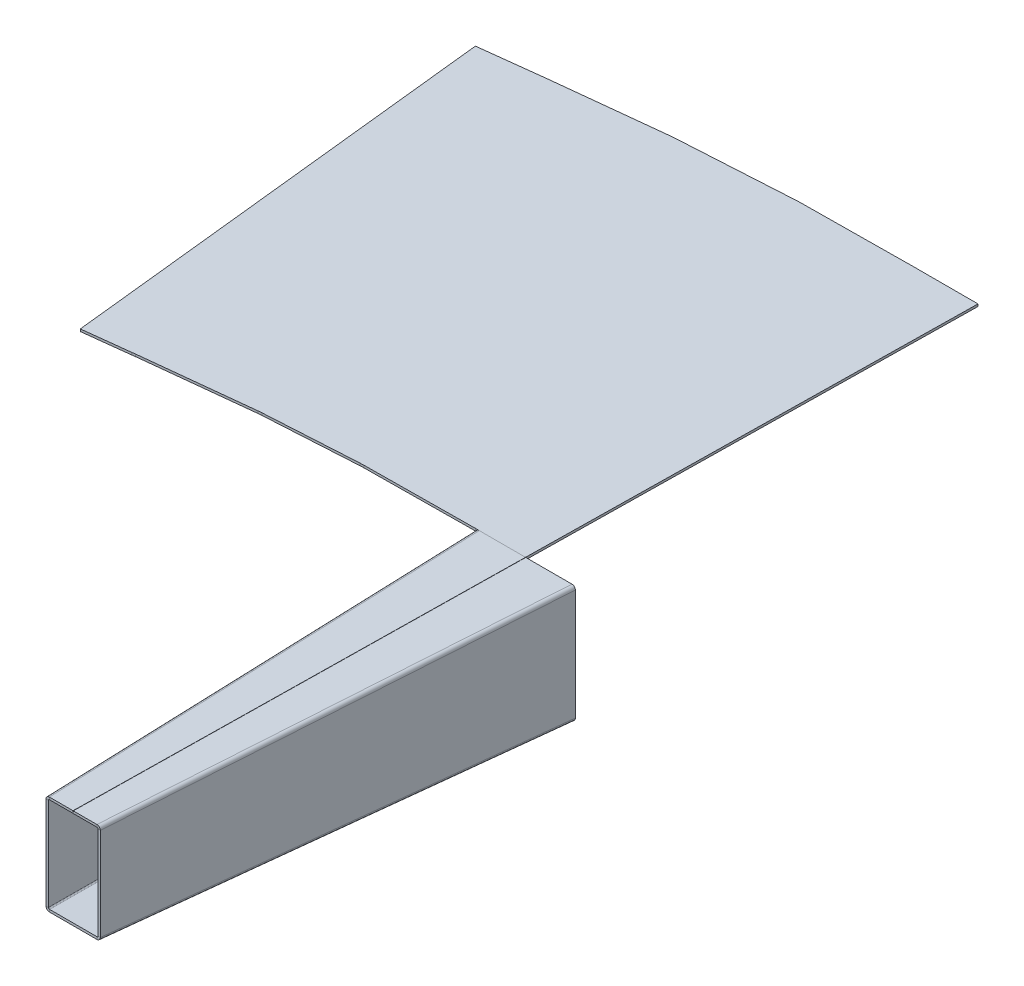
ISO-10303-21;
HEADER;
FILE_DESCRIPTION(('STEP AP214'),'2;1');
FILE_NAME('part.step','',(''),(''),'','','');
FILE_SCHEMA(('AUTOMOTIVE_DESIGN { 1 0 10303 214 1 1 1 1 }'));
ENDSEC;
DATA;
#1=APPLICATION_CONTEXT('core data for automotive mechanical design processes');
#2=APPLICATION_PROTOCOL_DEFINITION('international standard','automotive_design',2000,#1);
#3=PRODUCT_CONTEXT('',#1,'mechanical');
#4=PRODUCT('Part','Part','',(#3));
#5=PRODUCT_RELATED_PRODUCT_CATEGORY('part','',(#4));
#6=PRODUCT_DEFINITION_FORMATION('','',#4);
#7=PRODUCT_DEFINITION_CONTEXT('part definition',#1,'design');
#8=PRODUCT_DEFINITION('design','',#6,#7);
#9=PRODUCT_DEFINITION_SHAPE('','',#8);
#10=(LENGTH_UNIT() NAMED_UNIT(*) SI_UNIT(.MILLI.,.METRE.));
#11=(NAMED_UNIT(*) PLANE_ANGLE_UNIT() SI_UNIT($,.RADIAN.));
#12=(NAMED_UNIT(*) SI_UNIT($,.STERADIAN.) SOLID_ANGLE_UNIT());
#13=UNCERTAINTY_MEASURE_WITH_UNIT(LENGTH_MEASURE(1.E-05),#10,'distance_accuracy_value','');
#14=(GEOMETRIC_REPRESENTATION_CONTEXT(3) GLOBAL_UNCERTAINTY_ASSIGNED_CONTEXT((#13)) GLOBAL_UNIT_ASSIGNED_CONTEXT((#10,
#11,#12)) REPRESENTATION_CONTEXT('',''));
#15=CARTESIAN_POINT('',(0.,0.,0.));
#16=DIRECTION('',(0.,0.,1.));
#17=DIRECTION('',(1.,0.,0.));
#18=AXIS2_PLACEMENT_3D('',#15,#16,#17);
#19=CARTESIAN_POINT('',(-80.1392159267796,27.0088356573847,0.574044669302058));
#20=DIRECTION('',(-0.0599358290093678,-0.0149713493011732,-0.998089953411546));
#21=DIRECTION('',(-0.998202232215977,0.00089893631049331,0.0599290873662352));
#22=AXIS2_PLACEMENT_3D('',#19,#20,#21);
#23=PLANE('',#22);
#24=DIRECTION('',(0.,0.999887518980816,-0.0149983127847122));
#25=VECTOR('',#24,1.);
#26=CARTESIAN_POINT('',(-79.6390233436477,27.008385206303,0.544014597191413));
#27=LINE('',#26,#25);
#28=CARTESIAN_POINT('',(-79.6390233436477,26.0084976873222,0.559012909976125));
#29=VERTEX_POINT('',#28);
#30=CARTESIAN_POINT('',(-79.6390233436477,27.008385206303,0.54401459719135));
#31=VERTEX_POINT('',#30);
#32=EDGE_CURVE('E315',#29,#31,#27,.T.);
#33=ORIENTED_EDGE('',*,*,#32,.F.);
#34=DIRECTION('',(-0.998202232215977,0.00089893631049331,0.0599290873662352));
#35=VECTOR('',#34,1.);
#36=CARTESIAN_POINT('',(-80.1392159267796,26.0089481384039,0.58904298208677));
#37=LINE('',#36,#35);
#38=CARTESIAN_POINT('',(-130.54952012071,26.0543454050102,3.61552742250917));
#39=VERTEX_POINT('',#38);
#40=EDGE_CURVE('E526',#29,#39,#37,.T.);
#41=ORIENTED_EDGE('',*,*,#40,.T.);
#42=DIRECTION('',(0.,0.999887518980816,-0.0149983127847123));
#43=VECTOR('',#42,1.);
#44=CARTESIAN_POINT('',(-130.54952012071,27.054232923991,3.60052910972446));
#45=LINE('',#44,#43);
#46=CARTESIAN_POINT('',(-130.54952012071,27.054232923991,3.60052910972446));
#47=VERTEX_POINT('',#46);
#48=EDGE_CURVE('E512',#39,#47,#45,.T.);
#49=ORIENTED_EDGE('',*,*,#48,.T.);
#50=DIRECTION('',(-0.998202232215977,0.00089893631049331,0.0599290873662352));
#51=VECTOR('',#50,1.);
#52=CARTESIAN_POINT('',(-80.1392159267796,27.0088356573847,0.574044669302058));
#53=LINE('',#52,#51);
#54=EDGE_CURVE('E513',#31,#47,#53,.T.);
#55=ORIENTED_EDGE('',*,*,#54,.F.);
#56=EDGE_LOOP('',(#33,#41,#49,#55));
#57=FACE_BOUND('',#56,.T.);
#58=ADVANCED_FACE('F122',(#57),#23,.T.);
#59=CARTESIAN_POINT('',(-68.1483047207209,30.0040410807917,200.254406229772));
#60=DIRECTION('',(-0.0599358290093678,-0.0149713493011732,-0.998089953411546));
#61=DIRECTION('',(-0.998202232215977,0.00089893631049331,0.0599290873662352));
#62=AXIS2_PLACEMENT_3D('',#59,#60,#61);
#63=PLANE('',#62);
#64=DIRECTION('',(0.,0.999887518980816,-0.0149983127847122));
#65=VECTOR('',#64,1.);
#66=CARTESIAN_POINT('',(-113.567597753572,30.0449436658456,202.981245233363));
#67=LINE('',#66,#65);
#68=CARTESIAN_POINT('',(-113.567597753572,29.0450561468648,202.996243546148));
#69=VERTEX_POINT('',#68);
#70=CARTESIAN_POINT('',(-113.567597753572,30.0449436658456,202.981245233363));
#71=VERTEX_POINT('',#70);
#72=EDGE_CURVE('E487',#69,#71,#67,.T.);
#73=ORIENTED_EDGE('',*,*,#72,.F.);
#74=DIRECTION('',(-0.998202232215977,0.00089893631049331,0.0599290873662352));
#75=VECTOR('',#74,1.);
#76=CARTESIAN_POINT('',(-68.1483047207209,29.0041535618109,200.269404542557));
#77=LINE('',#76,#75);
#78=CARTESIAN_POINT('',(-72.6391232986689,29.0081977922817,200.539019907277));
#79=VERTEX_POINT('',#78);
#80=EDGE_CURVE('E663',#79,#69,#77,.T.);
#81=ORIENTED_EDGE('',*,*,#80,.F.);
#82=DIRECTION('',(0.,0.999887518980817,-0.014998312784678));
#83=VECTOR('',#82,1.);
#84=CARTESIAN_POINT('',(-72.6391232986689,30.0080853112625,200.524021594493));
#85=LINE('',#84,#83);
#86=CARTESIAN_POINT('',(-72.6391232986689,30.0080853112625,200.524021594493));
#87=VERTEX_POINT('',#86);
#88=EDGE_CURVE('E375',#79,#87,#85,.T.);
#89=ORIENTED_EDGE('',*,*,#88,.T.);
#90=DIRECTION('',(-0.998202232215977,0.00089893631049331,0.0599290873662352));
#91=VECTOR('',#90,1.);
#92=CARTESIAN_POINT('',(-68.1483047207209,30.0040410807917,200.254406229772));
#93=LINE('',#92,#91);
#94=EDGE_CURVE('E505',#87,#71,#93,.T.);
#95=ORIENTED_EDGE('',*,*,#94,.T.);
#96=EDGE_LOOP('',(#73,#81,#89,#95));
#97=FACE_BOUND('',#96,.T.);
#98=ADVANCED_FACE('F607',(#97),#63,.F.);
#99=CARTESIAN_POINT('',(25.,26.9997750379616,-0.0299966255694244));
#100=DIRECTION('',(0.,0.999887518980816,-0.0149983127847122));
#101=DIRECTION('',(0.,0.0149983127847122,0.999887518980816));
#102=AXIS2_PLACEMENT_3D('',#99,#100,#101);
#103=PLANE('',#102);
#104=ORIENTED_EDGE('',*,*,#94,.F.);
#105=CARTESIAN_POINT('',(-72.6391232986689,30.0080853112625,200.524021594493));
#106=CARTESIAN_POINT('',(-71.8519043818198,30.0072399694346,200.46766547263));
#107=CARTESIAN_POINT('',(-71.0699123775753,30.0072615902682,200.469106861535));
#108=B_SPLINE_CURVE_WITH_KNOTS('',2,(#105,#106,#107),.UNSPECIFIED.,.F.,.F.,(3,3),(0.,1.),.UNSPECIFIED.);
#109=CARTESIAN_POINT('',(-71.0699123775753,30.0072615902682,200.469106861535));
#110=VERTEX_POINT('',#109);
#111=EDGE_CURVE('E543',#87,#110,#108,.T.);
#112=ORIENTED_EDGE('',*,*,#111,.T.);
#113=DIRECTION('',(-0.99995002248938,0.000149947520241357,0.00999650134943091));
#114=VECTOR('',#113,1.);
#115=CARTESIAN_POINT('',(-25.5710929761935,30.0004388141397,200.014255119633));
#116=LINE('',#115,#114);
#117=CARTESIAN_POINT('',(-22.071773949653,29.9999140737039,199.979272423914));
#118=VERTEX_POINT('',#117);
#119=EDGE_CURVE('E571',#118,#110,#116,.T.);
#120=ORIENTED_EDGE('',*,*,#119,.F.);
#121=DIRECTION('',(0.999913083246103,0.000197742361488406,0.0131828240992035));
#122=VECTOR('',#121,1.);
#123=CARTESIAN_POINT('',(-22.071773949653,29.9999140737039,199.979272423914));
#124=LINE('',#123,#122);
#125=CARTESIAN_POINT('',(-20.4995937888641,30.0002249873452,200.));
#126=VERTEX_POINT('',#125);
#127=EDGE_CURVE('E301',#118,#126,#124,.T.);
#128=ORIENTED_EDGE('',*,*,#127,.T.);
#129=DIRECTION('',(-1.,0.,0.));
#130=VECTOR('',#129,1.);
#131=CARTESIAN_POINT('',(25.,30.0002249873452,200.));
#132=LINE('',#131,#130);
#133=CARTESIAN_POINT('',(-0.0500000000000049,30.0002249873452,200.));
#134=VERTEX_POINT('',#133);
#135=EDGE_CURVE('E288',#134,#126,#132,.T.);
#136=ORIENTED_EDGE('',*,*,#135,.F.);
#137=DIRECTION('',(0.,0.0149983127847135,0.999887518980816));
#138=VECTOR('',#137,1.);
#139=CARTESIAN_POINT('',(-0.0500000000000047,26.741920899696,-17.2202725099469));
#140=LINE('',#139,#138);
#141=CARTESIAN_POINT('',(-0.0500000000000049,27.0002249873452,0.));
#142=VERTEX_POINT('',#141);
#143=EDGE_CURVE('E274',#142,#134,#140,.T.);
#144=ORIENTED_EDGE('',*,*,#143,.F.);
#145=DIRECTION('',(-1.,0.,0.));
#146=VECTOR('',#145,1.);
#147=CARTESIAN_POINT('',(25.,27.0002249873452,0.));
#148=LINE('',#147,#146);
#149=CARTESIAN_POINT('',(-25.4995937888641,27.0002249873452,0.));
#150=VERTEX_POINT('',#149);
#151=EDGE_CURVE('E269',#142,#150,#148,.T.);
#152=ORIENTED_EDGE('',*,*,#151,.T.);
#153=DIRECTION('',(-0.999913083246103,-0.000197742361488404,-0.0131828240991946));
#154=VECTOR('',#153,1.);
#155=CARTESIAN_POINT('',(-25.4995937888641,27.0002249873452,0.));
#156=LINE('',#155,#154);
#157=CARTESIAN_POINT('',(-27.071773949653,26.9999140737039,-0.0207275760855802));
#158=VERTEX_POINT('',#157);
#159=EDGE_CURVE('E298',#150,#158,#156,.T.);
#160=ORIENTED_EDGE('',*,*,#159,.T.);
#161=DIRECTION('',(-0.99995002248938,0.000149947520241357,0.00999650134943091));
#162=VECTOR('',#161,1.);
#163=CARTESIAN_POINT('',(-27.5712429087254,26.9999889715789,-0.0157343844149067));
#164=LINE('',#163,#162);
#165=CARTESIAN_POINT('',(-78.0698124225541,27.0075614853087,0.489099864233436));
#166=VERTEX_POINT('',#165);
#167=EDGE_CURVE('E573',#158,#166,#164,.T.);
#168=ORIENTED_EDGE('',*,*,#167,.T.);
#169=CARTESIAN_POINT('',(-78.0698124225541,27.0075614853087,0.489099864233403));
#170=CARTESIAN_POINT('',(-78.8564051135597,27.0075437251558,0.487915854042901));
#171=CARTESIAN_POINT('',(-79.6390233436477,27.008385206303,0.544014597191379));
#172=B_SPLINE_CURVE_WITH_KNOTS('',2,(#169,#170,#171),.UNSPECIFIED.,.F.,.F.,(3,3),(0.,1.),.UNSPECIFIED.);
#173=EDGE_CURVE('E634',#166,#31,#172,.T.);
#174=ORIENTED_EDGE('',*,*,#173,.T.);
#175=ORIENTED_EDGE('',*,*,#54,.T.);
#176=CARTESIAN_POINT('',(-130.54952012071,27.054232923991,3.60052910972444));
#177=CARTESIAN_POINT('',(-131.335189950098,27.0548045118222,3.63863496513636));
#178=CARTESIAN_POINT('',(-132.114028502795,27.0562312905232,3.73375354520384));
#179=B_SPLINE_CURVE_WITH_KNOTS('',2,(#176,#177,#178),.UNSPECIFIED.,.F.,.F.,(3,3),(0.,1.),.UNSPECIFIED.);
#180=CARTESIAN_POINT('',(-132.114028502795,27.0562312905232,3.7337535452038));
#181=VERTEX_POINT('',#180);
#182=EDGE_CURVE('E659',#47,#181,#179,.T.);
#183=ORIENTED_EDGE('',*,*,#182,.T.);
#184=DIRECTION('',(-0.993962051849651,0.00164568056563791,0.109712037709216));
#185=VECTOR('',#184,1.);
#186=CARTESIAN_POINT('',(-132.612096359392,27.0570559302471,3.78872952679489));
#187=LINE('',#186,#185);
#188=CARTESIAN_POINT('',(-182.806676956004,27.1401619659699,9.32913190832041));
#189=VERTEX_POINT('',#188);
#190=EDGE_CURVE('E393',#181,#189,#187,.T.);
#191=ORIENTED_EDGE('',*,*,#190,.T.);
#192=DIRECTION('',(-0.99115151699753,0.00199080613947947,0.132720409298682));
#193=VECTOR('',#192,1.);
#194=CARTESIAN_POINT('',(-182.806676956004,27.1401619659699,9.32913190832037));
#195=LINE('',#194,#193);
#196=CARTESIAN_POINT('',(-184.365081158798,27.1432921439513,9.53781044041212));
#197=VERTEX_POINT('',#196);
#198=EDGE_CURVE('E390',#189,#197,#195,.T.);
#199=ORIENTED_EDGE('',*,*,#198,.T.);
#200=DIRECTION('',(-0.99281539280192,0.00179464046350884,0.119642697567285));
#201=VECTOR('',#200,1.);
#202=CARTESIAN_POINT('',(-184.86108556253,27.1441887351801,9.59758318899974));
#203=LINE('',#202,#201);
#204=CARTESIAN_POINT('',(-209.631829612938,27.1889650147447,12.5826684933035));
#205=VERTEX_POINT('',#204);
#206=EDGE_CURVE('E409',#197,#205,#203,.T.);
#207=ORIENTED_EDGE('',*,*,#206,.T.);
#208=DIRECTION('',(0.119656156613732,0.0148905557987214,0.992703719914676));
#209=VECTOR('',#208,1.);
#210=CARTESIAN_POINT('',(-211.69257303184,26.9325167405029,-4.51388312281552));
#211=LINE('',#210,#209);
#212=CARTESIAN_POINT('',(-185.697906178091,30.1674111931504,211.145747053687));
#213=VERTEX_POINT('',#212);
#214=EDGE_CURVE('E429',#213,#205,#211,.F.);
#215=ORIENTED_EDGE('',*,*,#214,.F.);
#216=DIRECTION('',(-0.99281539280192,0.00179464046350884,0.119642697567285));
#217=VECTOR('',#216,1.);
#218=CARTESIAN_POINT('',(-160.927162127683,30.1226349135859,208.160661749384));
#219=LINE('',#218,#217);
#220=CARTESIAN_POINT('',(-165.39523468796,30.1307115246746,208.699102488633));
#221=VERTEX_POINT('',#220);
#222=EDGE_CURVE('E423',#221,#213,#219,.T.);
#223=ORIENTED_EDGE('',*,*,#222,.F.);
#224=DIRECTION('',(0.991151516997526,-0.00199080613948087,-0.132720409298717));
#225=VECTOR('',#224,1.);
#226=CARTESIAN_POINT('',(-165.39523468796,30.1307115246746,208.699102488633));
#227=LINE('',#226,#225);
#228=CARTESIAN_POINT('',(-163.836830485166,30.1275813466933,208.490423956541));
#229=VERTEX_POINT('',#228);
#230=EDGE_CURVE('E394',#221,#229,#227,.T.);
#231=ORIENTED_EDGE('',*,*,#230,.T.);
#232=DIRECTION('',(-0.993962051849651,0.00164568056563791,0.109712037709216));
#233=VECTOR('',#232,1.);
#234=CARTESIAN_POINT('',(-110.660363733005,30.0395382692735,202.620885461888));
#235=LINE('',#234,#233);
#236=CARTESIAN_POINT('',(-115.132106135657,30.0469420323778,203.114469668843));
#237=VERTEX_POINT('',#236);
#238=EDGE_CURVE('E552',#237,#229,#235,.T.);
#239=ORIENTED_EDGE('',*,*,#238,.F.);
#240=CARTESIAN_POINT('',(-115.132106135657,30.0469420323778,203.114469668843));
#241=CARTESIAN_POINT('',(-114.352045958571,30.0455141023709,203.019274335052));
#242=CARTESIAN_POINT('',(-113.567597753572,30.0449436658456,202.981245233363));
#243=B_SPLINE_CURVE_WITH_KNOTS('',2,(#240,#241,#242),.UNSPECIFIED.,.F.,.F.,(3,3),(0.,1.),.UNSPECIFIED.);
#244=EDGE_CURVE('E658',#237,#71,#243,.T.);
#245=ORIENTED_EDGE('',*,*,#244,.T.);
#246=EDGE_LOOP('',(#104,#112,#120,#128,#136,#144,#152,#160,#168,#174,#175,#183,#191,#199,#207,
#215,#223,#231,#239,#245));
#247=FACE_BOUND('',#246,.T.);
#248=ADVANCED_FACE('F124',(#247),#103,.T.);
#249=CARTESIAN_POINT('',(-80.1362191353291,26.0096967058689,0.638947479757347));
#250=DIRECTION('',(0.,0.999887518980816,-0.0149983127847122));
#251=DIRECTION('',(-0.0599358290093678,-0.0149713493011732,-0.998089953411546));
#252=AXIS2_PLACEMENT_3D('',#249,#250,#251);
#253=PLANE('',#252);
#254=ORIENTED_EDGE('',*,*,#80,.T.);
#255=CARTESIAN_POINT('',(-115.132106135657,29.047054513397,203.129467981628));
#256=CARTESIAN_POINT('',(-114.352045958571,29.0456265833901,203.034272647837));
#257=CARTESIAN_POINT('',(-113.567597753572,29.0450561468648,202.996243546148));
#258=B_SPLINE_CURVE_WITH_KNOTS('',2,(#255,#256,#257),.UNSPECIFIED.,.F.,.F.,(3,3),(0.,1.),.UNSPECIFIED.);
#259=CARTESIAN_POINT('',(-115.132106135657,29.047054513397,203.129467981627));
#260=VERTEX_POINT('',#259);
#261=EDGE_CURVE('E631',#260,#69,#258,.T.);
#262=ORIENTED_EDGE('',*,*,#261,.F.);
#263=DIRECTION('',(-0.993962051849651,0.00164568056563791,0.109712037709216));
#264=VECTOR('',#263,1.);
#265=CARTESIAN_POINT('',(-110.660363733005,29.0396507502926,202.635883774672));
#266=LINE('',#265,#264);
#267=CARTESIAN_POINT('',(-163.836830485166,29.1276938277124,208.505422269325));
#268=VERTEX_POINT('',#267);
#269=EDGE_CURVE('E388',#260,#268,#266,.T.);
#270=ORIENTED_EDGE('',*,*,#269,.T.);
#271=DIRECTION('',(0.991151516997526,-0.00199080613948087,-0.132720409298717));
#272=VECTOR('',#271,1.);
#273=CARTESIAN_POINT('',(-165.39523468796,29.1308240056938,208.714100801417));
#274=LINE('',#273,#272);
#275=CARTESIAN_POINT('',(-165.39523468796,29.1308240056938,208.714100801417));
#276=VERTEX_POINT('',#275);
#277=EDGE_CURVE('E406',#276,#268,#274,.T.);
#278=ORIENTED_EDGE('',*,*,#277,.F.);
#279=DIRECTION('',(0.99281539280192,-0.00179464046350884,-0.119642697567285));
#280=VECTOR('',#279,1.);
#281=CARTESIAN_POINT('',(-160.927162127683,29.1227473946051,208.175660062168));
#282=LINE('',#281,#280);
#283=CARTESIAN_POINT('',(-185.697906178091,29.1675236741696,211.160745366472));
#284=VERTEX_POINT('',#283);
#285=EDGE_CURVE('E420',#276,#284,#282,.F.);
#286=ORIENTED_EDGE('',*,*,#285,.T.);
#287=DIRECTION('',(0.119656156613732,0.0148905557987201,0.992703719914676));
#288=VECTOR('',#287,1.);
#289=CARTESIAN_POINT('',(-209.635419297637,26.1886307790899,12.5678856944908));
#290=LINE('',#289,#288);
#291=CARTESIAN_POINT('',(-209.631829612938,26.1890774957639,12.5976668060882));
#292=VERTEX_POINT('',#291);
#293=EDGE_CURVE('E417',#284,#292,#290,.F.);
#294=ORIENTED_EDGE('',*,*,#293,.T.);
#295=DIRECTION('',(0.99281539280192,-0.00179464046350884,-0.119642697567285));
#296=VECTOR('',#295,1.);
#297=CARTESIAN_POINT('',(-184.86108556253,26.1443012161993,9.61258150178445));
#298=LINE('',#297,#296);
#299=CARTESIAN_POINT('',(-184.365081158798,26.1434046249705,9.55280875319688));
#300=VERTEX_POINT('',#299);
#301=EDGE_CURVE('E414',#300,#292,#298,.F.);
#302=ORIENTED_EDGE('',*,*,#301,.F.);
#303=DIRECTION('',(-0.99115151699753,0.00199080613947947,0.132720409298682));
#304=VECTOR('',#303,1.);
#305=CARTESIAN_POINT('',(-182.806676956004,26.1402744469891,9.34413022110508));
#306=LINE('',#305,#304);
#307=CARTESIAN_POINT('',(-182.806676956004,26.1402744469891,9.34413022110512));
#308=VERTEX_POINT('',#307);
#309=EDGE_CURVE('E400',#308,#300,#306,.T.);
#310=ORIENTED_EDGE('',*,*,#309,.F.);
#311=DIRECTION('',(-0.993962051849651,0.00164568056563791,0.109712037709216));
#312=VECTOR('',#311,1.);
#313=CARTESIAN_POINT('',(-132.612096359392,26.0571684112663,3.8037278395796));
#314=LINE('',#313,#312);
#315=CARTESIAN_POINT('',(-132.114028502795,26.0563437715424,3.74875185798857));
#316=VERTEX_POINT('',#315);
#317=EDGE_CURVE('E389',#316,#308,#314,.T.);
#318=ORIENTED_EDGE('',*,*,#317,.F.);
#319=CARTESIAN_POINT('',(-130.54952012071,26.0543454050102,3.61552742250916));
#320=CARTESIAN_POINT('',(-131.335189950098,26.0549169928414,3.65363327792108));
#321=CARTESIAN_POINT('',(-132.114028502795,26.0563437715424,3.74875185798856));
#322=B_SPLINE_CURVE_WITH_KNOTS('',2,(#319,#320,#321),.UNSPECIFIED.,.F.,.F.,(3,3),(0.,1.),.UNSPECIFIED.);
#323=EDGE_CURVE('E628',#39,#316,#322,.T.);
#324=ORIENTED_EDGE('',*,*,#323,.F.);
#325=ORIENTED_EDGE('',*,*,#40,.F.);
#326=CARTESIAN_POINT('',(-78.0698124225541,26.0076739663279,0.50409817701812));
#327=CARTESIAN_POINT('',(-78.8564051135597,26.007656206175,0.502914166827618));
#328=CARTESIAN_POINT('',(-79.6390233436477,26.0084976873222,0.559012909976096));
#329=B_SPLINE_CURVE_WITH_KNOTS('',2,(#326,#327,#328),.UNSPECIFIED.,.F.,.F.,(3,3),(0.,1.),.UNSPECIFIED.);
#330=CARTESIAN_POINT('',(-78.0698124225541,26.0076739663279,0.504098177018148));
#331=VERTEX_POINT('',#330);
#332=EDGE_CURVE('E126',#331,#29,#329,.T.);
#333=ORIENTED_EDGE('',*,*,#332,.F.);
#334=DIRECTION('',(0.99995002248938,-0.000149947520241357,-0.00999650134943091));
#335=VECTOR('',#334,1.);
#336=CARTESIAN_POINT('',(-27.5712429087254,26.0001014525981,-0.000736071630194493));
#337=LINE('',#336,#335);
#338=CARTESIAN_POINT('',(-27.071773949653,26.0000265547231,-0.00572926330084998));
#339=VERTEX_POINT('',#338);
#340=EDGE_CURVE('E140',#339,#331,#337,.F.);
#341=ORIENTED_EDGE('',*,*,#340,.F.);
#342=DIRECTION('',(-0.999913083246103,-0.000197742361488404,-0.0131828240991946));
#343=VECTOR('',#342,1.);
#344=CARTESIAN_POINT('',(-25.4995937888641,26.0003374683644,0.0149983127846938));
#345=LINE('',#344,#343);
#346=CARTESIAN_POINT('',(-25.4995937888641,26.0003374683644,0.0149983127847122));
#347=VERTEX_POINT('',#346);
#348=EDGE_CURVE('E281',#347,#339,#345,.T.);
#349=ORIENTED_EDGE('',*,*,#348,.F.);
#350=DIRECTION('',(1.,0.,0.));
#351=VECTOR('',#350,1.);
#352=CARTESIAN_POINT('',(25.,26.0003374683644,0.0149983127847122));
#353=LINE('',#352,#351);
#354=CARTESIAN_POINT('',(-0.0500000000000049,26.0003374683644,0.0149983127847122));
#355=VERTEX_POINT('',#354);
#356=EDGE_CURVE('E267',#355,#347,#353,.F.);
#357=ORIENTED_EDGE('',*,*,#356,.F.);
#358=DIRECTION('',(0.,0.0149983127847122,0.999887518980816));
#359=VECTOR('',#358,1.);
#360=CARTESIAN_POINT('',(-0.0500000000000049,25.9998875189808,-0.0149983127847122));
#361=LINE('',#360,#359);
#362=CARTESIAN_POINT('',(-0.0500000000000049,29.0003374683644,200.014998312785));
#363=VERTEX_POINT('',#362);
#364=EDGE_CURVE('E279',#355,#363,#361,.T.);
#365=ORIENTED_EDGE('',*,*,#364,.T.);
#366=DIRECTION('',(1.,0.,0.));
#367=VECTOR('',#366,1.);
#368=CARTESIAN_POINT('',(25.,29.0003374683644,200.014998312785));
#369=LINE('',#368,#367);
#370=CARTESIAN_POINT('',(-20.4995937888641,29.0003374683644,200.014998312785));
#371=VERTEX_POINT('',#370);
#372=EDGE_CURVE('E283',#363,#371,#369,.F.);
#373=ORIENTED_EDGE('',*,*,#372,.T.);
#374=DIRECTION('',(0.999913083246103,0.000197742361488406,0.0131828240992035));
#375=VECTOR('',#374,1.);
#376=CARTESIAN_POINT('',(-22.071773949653,29.0000265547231,199.994270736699));
#377=LINE('',#376,#375);
#378=CARTESIAN_POINT('',(-22.071773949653,29.0000265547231,199.994270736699));
#379=VERTEX_POINT('',#378);
#380=EDGE_CURVE('E302',#379,#371,#377,.T.);
#381=ORIENTED_EDGE('',*,*,#380,.F.);
#382=DIRECTION('',(0.99995002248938,-0.000149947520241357,-0.00999650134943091));
#383=VECTOR('',#382,1.);
#384=CARTESIAN_POINT('',(-25.5710929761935,29.0005512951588,200.029253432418));
#385=LINE('',#384,#383);
#386=CARTESIAN_POINT('',(-71.0699123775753,29.0073740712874,200.484105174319));
#387=VERTEX_POINT('',#386);
#388=EDGE_CURVE('E148',#379,#387,#385,.F.);
#389=ORIENTED_EDGE('',*,*,#388,.T.);
#390=CARTESIAN_POINT('',(-72.6391232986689,29.0081977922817,200.539019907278));
#391=CARTESIAN_POINT('',(-71.8519043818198,29.0073524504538,200.482663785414));
#392=CARTESIAN_POINT('',(-71.0699123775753,29.0073740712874,200.48410517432));
#393=B_SPLINE_CURVE_WITH_KNOTS('',2,(#390,#391,#392),.UNSPECIFIED.,.F.,.F.,(3,3),(0.,1.),.UNSPECIFIED.);
#394=EDGE_CURVE('E664',#79,#387,#393,.T.);
#395=ORIENTED_EDGE('',*,*,#394,.F.);
#396=EDGE_LOOP('',(#254,#262,#270,#278,#286,#294,#302,#310,#318,#324,#325,#333,#341,#349,#357,
#365,#373,#381,#389,#395));
#397=FACE_BOUND('',#396,.T.);
#398=ADVANCED_FACE('F278',(#397),#253,.F.);
#399=CARTESIAN_POINT('',(-130.54952012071,27.054232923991,3.60052910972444));
#400=CARTESIAN_POINT('',(-131.073300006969,27.0546139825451,3.62593301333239));
#401=CARTESIAN_POINT('',(-131.594802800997,27.0552801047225,3.67034115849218));
#402=CARTESIAN_POINT('',(-132.114028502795,27.0562312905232,3.73375354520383));
#403=CARTESIAN_POINT('',(-130.54952012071,26.0543454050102,3.61552742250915));
#404=CARTESIAN_POINT('',(-131.073300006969,26.0547264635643,3.6409313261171));
#405=CARTESIAN_POINT('',(-131.594802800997,26.0553925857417,3.68533947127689));
#406=CARTESIAN_POINT('',(-132.114028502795,26.0563437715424,3.74875185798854));
#407=B_SPLINE_SURFACE_WITH_KNOTS('',1,3,((#399,#400,#401,#402),(#403,#404,#405,#406)),
.UNSPECIFIED.,.F.,.F.,.F.,(2,2),(4,4),(0.,1.),(0.,1.),.UNSPECIFIED.);
#408=DIRECTION('',(0.,0.999887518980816,-0.0149983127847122));
#409=VECTOR('',#408,1.);
#410=CARTESIAN_POINT('',(-132.114028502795,27.0562312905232,3.73375354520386));
#411=LINE('',#410,#409);
#412=EDGE_CURVE('E434',#316,#181,#411,.T.);
#413=ORIENTED_EDGE('',*,*,#48,.F.);
#414=ORIENTED_EDGE('',*,*,#323,.T.);
#415=ORIENTED_EDGE('',*,*,#412,.T.);
#416=ORIENTED_EDGE('',*,*,#182,.F.);
#417=EDGE_LOOP('',(#413,#414,#415,#416));
#418=FACE_BOUND('',#417,.T.);
#419=ADVANCED_FACE('F448',(#418),#407,.T.);
#420=CARTESIAN_POINT('',(-115.132106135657,30.0469420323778,203.114469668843));
#421=CARTESIAN_POINT('',(-114.6120660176,30.0459900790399,203.051006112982));
#422=CARTESIAN_POINT('',(-114.090563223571,30.0453239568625,203.006597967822));
#423=CARTESIAN_POINT('',(-113.567597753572,30.0449436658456,202.981245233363));
#424=CARTESIAN_POINT('',(-115.132106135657,29.047054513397,203.129467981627));
#425=CARTESIAN_POINT('',(-114.6120660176,29.0461025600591,203.066004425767));
#426=CARTESIAN_POINT('',(-114.090563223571,29.0454364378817,203.021596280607));
#427=CARTESIAN_POINT('',(-113.567597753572,29.0450561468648,202.996243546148));
#428=B_SPLINE_SURFACE_WITH_KNOTS('',1,3,((#420,#421,#422,#423),(#424,#425,#426,#427)),
.UNSPECIFIED.,.F.,.F.,.F.,(2,2),(4,4),(0.,1.),(0.,1.),.UNSPECIFIED.);
#429=DIRECTION('',(0.,0.999887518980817,-0.0149983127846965));
#430=VECTOR('',#429,1.);
#431=CARTESIAN_POINT('',(-115.132106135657,30.0469420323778,203.114469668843));
#432=LINE('',#431,#430);
#433=EDGE_CURVE('E500',#260,#237,#432,.T.);
#434=ORIENTED_EDGE('',*,*,#261,.T.);
#435=ORIENTED_EDGE('',*,*,#72,.T.);
#436=ORIENTED_EDGE('',*,*,#244,.F.);
#437=ORIENTED_EDGE('',*,*,#433,.F.);
#438=EDGE_LOOP('',(#434,#435,#436,#437));
#439=FACE_BOUND('',#438,.T.);
#440=ADVANCED_FACE('F460',(#439),#428,.T.);
#441=CARTESIAN_POINT('',(-211.69257303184,26.9325167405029,-4.51388312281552));
#442=DIRECTION('',(-0.99281539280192,0.00179464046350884,0.119642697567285));
#443=DIRECTION('',(0.119656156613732,0.0148905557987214,0.992703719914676));
#444=AXIS2_PLACEMENT_3D('',#441,#442,#443);
#445=PLANE('',#444);
#446=DIRECTION('',(0.,0.999887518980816,-0.0149983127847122));
#447=VECTOR('',#446,1.);
#448=CARTESIAN_POINT('',(-209.631829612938,27.1889650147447,12.5826684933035));
#449=LINE('',#448,#447);
#450=EDGE_CURVE('E412',#292,#205,#449,.T.);
#451=ORIENTED_EDGE('',*,*,#450,.F.);
#452=ORIENTED_EDGE('',*,*,#293,.F.);
#453=DIRECTION('',(0.,0.999887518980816,-0.0149983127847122));
#454=VECTOR('',#453,1.);
#455=CARTESIAN_POINT('',(-185.697906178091,30.1674111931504,211.145747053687));
#456=LINE('',#455,#454);
#457=EDGE_CURVE('E432',#284,#213,#456,.T.);
#458=ORIENTED_EDGE('',*,*,#457,.T.);
#459=ORIENTED_EDGE('',*,*,#214,.T.);
#460=EDGE_LOOP('',(#451,#452,#458,#459));
#461=FACE_BOUND('',#460,.T.);
#462=ADVANCED_FACE('F684',(#461),#445,.T.);
#463=CARTESIAN_POINT('',(-160.927162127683,30.1226349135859,208.160661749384));
#464=DIRECTION('',(-0.119656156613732,-0.0148905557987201,-0.992703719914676));
#465=DIRECTION('',(-0.99281539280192,0.00179464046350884,0.119642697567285));
#466=AXIS2_PLACEMENT_3D('',#463,#464,#465);
#467=PLANE('',#466);
#468=ORIENTED_EDGE('',*,*,#457,.F.);
#469=ORIENTED_EDGE('',*,*,#285,.F.);
#470=DIRECTION('',(0.,0.999887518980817,-0.0149983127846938));
#471=VECTOR('',#470,1.);
#472=CARTESIAN_POINT('',(-165.39523468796,30.1307115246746,208.699102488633));
#473=LINE('',#472,#471);
#474=EDGE_CURVE('E426',#276,#221,#473,.T.);
#475=ORIENTED_EDGE('',*,*,#474,.T.);
#476=ORIENTED_EDGE('',*,*,#222,.T.);
#477=EDGE_LOOP('',(#468,#469,#475,#476));
#478=FACE_BOUND('',#477,.T.);
#479=ADVANCED_FACE('F776',(#478),#467,.F.);
#480=CARTESIAN_POINT('',(-184.86108556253,27.1441887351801,9.59758318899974));
#481=DIRECTION('',(-0.119656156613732,-0.0148905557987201,-0.992703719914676));
#482=DIRECTION('',(-0.99281539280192,0.00179464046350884,0.119642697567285));
#483=AXIS2_PLACEMENT_3D('',#480,#481,#482);
#484=PLANE('',#483);
#485=DIRECTION('',(0.,0.999887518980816,-0.0149983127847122));
#486=VECTOR('',#485,1.);
#487=CARTESIAN_POINT('',(-184.365081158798,27.1432921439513,9.53781044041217));
#488=LINE('',#487,#486);
#489=EDGE_CURVE('E397',#300,#197,#488,.T.);
#490=ORIENTED_EDGE('',*,*,#489,.F.);
#491=ORIENTED_EDGE('',*,*,#301,.T.);
#492=ORIENTED_EDGE('',*,*,#450,.T.);
#493=ORIENTED_EDGE('',*,*,#206,.F.);
#494=EDGE_LOOP('',(#490,#491,#492,#493));
#495=FACE_BOUND('',#494,.T.);
#496=ADVANCED_FACE('F688',(#495),#484,.T.);
#497=CARTESIAN_POINT('',(-165.39523468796,29.6307677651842,208.706601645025));
#498=DIRECTION('',(0.132735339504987,0.0148656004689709,0.991040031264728));
#499=DIRECTION('',(0.991151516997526,-0.00199080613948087,-0.132720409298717));
#500=AXIS2_PLACEMENT_3D('',#497,#498,#499);
#501=PLANE('',#500);
#502=ORIENTED_EDGE('',*,*,#277,.T.);
#503=DIRECTION('',(0.,0.999887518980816,-0.0149983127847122));
#504=VECTOR('',#503,1.);
#505=CARTESIAN_POINT('',(-163.836830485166,30.1275813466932,208.490423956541));
#506=LINE('',#505,#504);
#507=EDGE_CURVE('E403',#268,#229,#506,.T.);
#508=ORIENTED_EDGE('',*,*,#507,.T.);
#509=ORIENTED_EDGE('',*,*,#230,.F.);
#510=ORIENTED_EDGE('',*,*,#474,.F.);
#511=EDGE_LOOP('',(#502,#508,#509,#510));
#512=FACE_BOUND('',#511,.T.);
#513=ADVANCED_FACE('F680',(#512),#501,.T.);
#514=CARTESIAN_POINT('',(-182.806676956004,26.6402182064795,9.33663106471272));
#515=DIRECTION('',(-0.132735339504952,-0.014865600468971,-0.991040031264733));
#516=DIRECTION('',(-0.99115151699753,0.00199080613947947,0.132720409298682));
#517=AXIS2_PLACEMENT_3D('',#514,#515,#516);
#518=PLANE('',#517);
#519=DIRECTION('',(0.,0.999887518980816,-0.014998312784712));
#520=VECTOR('',#519,1.);
#521=CARTESIAN_POINT('',(-182.806676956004,27.1401619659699,9.32913190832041));
#522=LINE('',#521,#520);
#523=EDGE_CURVE('E380',#308,#189,#522,.T.);
#524=ORIENTED_EDGE('',*,*,#523,.F.);
#525=ORIENTED_EDGE('',*,*,#309,.T.);
#526=ORIENTED_EDGE('',*,*,#489,.T.);
#527=ORIENTED_EDGE('',*,*,#198,.F.);
#528=EDGE_LOOP('',(#524,#525,#526,#527));
#529=FACE_BOUND('',#528,.T.);
#530=ADVANCED_FACE('F692',(#529),#518,.T.);
#531=CARTESIAN_POINT('',(-132.612096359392,27.0570559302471,3.78872952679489));
#532=DIRECTION('',(-0.109724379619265,-0.0149077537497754,-0.993850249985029));
#533=DIRECTION('',(-0.993962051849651,0.00164568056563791,0.109712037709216));
#534=AXIS2_PLACEMENT_3D('',#531,#532,#533);
#535=PLANE('',#534);
#536=ORIENTED_EDGE('',*,*,#412,.F.);
#537=ORIENTED_EDGE('',*,*,#317,.T.);
#538=ORIENTED_EDGE('',*,*,#523,.T.);
#539=ORIENTED_EDGE('',*,*,#190,.F.);
#540=EDGE_LOOP('',(#536,#537,#538,#539));
#541=FACE_BOUND('',#540,.T.);
#542=ADVANCED_FACE('F696',(#541),#535,.T.);
#543=CARTESIAN_POINT('',(-110.660363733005,30.0395382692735,202.620885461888));
#544=DIRECTION('',(-0.109724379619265,-0.0149077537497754,-0.993850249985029));
#545=DIRECTION('',(-0.993962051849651,0.00164568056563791,0.109712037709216));
#546=AXIS2_PLACEMENT_3D('',#543,#544,#545);
#547=PLANE('',#546);
#548=ORIENTED_EDGE('',*,*,#507,.F.);
#549=ORIENTED_EDGE('',*,*,#269,.F.);
#550=ORIENTED_EDGE('',*,*,#433,.T.);
#551=ORIENTED_EDGE('',*,*,#238,.T.);
#552=EDGE_LOOP('',(#548,#549,#550,#551));
#553=FACE_BOUND('',#552,.T.);
#554=ADVANCED_FACE('F336',(#553),#547,.F.);
#555=CARTESIAN_POINT('',(-78.0698124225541,27.0075614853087,0.489099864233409));
#556=CARTESIAN_POINT('',(-78.5942075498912,27.0075496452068,0.488310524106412));
#557=CARTESIAN_POINT('',(-79.1172778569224,27.0078242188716,0.506615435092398));
#558=CARTESIAN_POINT('',(-79.6390233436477,27.008385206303,0.544014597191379));
#559=CARTESIAN_POINT('',(-78.0698124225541,26.0076739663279,0.504098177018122));
#560=CARTESIAN_POINT('',(-78.5942075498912,26.007662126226,0.503308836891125));
#561=CARTESIAN_POINT('',(-79.1172778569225,26.0079366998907,0.521613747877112));
#562=CARTESIAN_POINT('',(-79.6390233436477,26.0084976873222,0.559012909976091));
#563=B_SPLINE_SURFACE_WITH_KNOTS('',1,3,((#555,#556,#557,#558),(#559,#560,#561,#562)),
.UNSPECIFIED.,.F.,.F.,.F.,(2,2),(4,4),(0.,1.),(0.,1.),.UNSPECIFIED.);
#564=DIRECTION('',(0.,0.999887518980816,-0.0149983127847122));
#565=VECTOR('',#564,1.);
#566=CARTESIAN_POINT('',(-78.0698124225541,27.0075614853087,0.489099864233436));
#567=LINE('',#566,#565);
#568=EDGE_CURVE('E588',#331,#166,#567,.T.);
#569=ORIENTED_EDGE('',*,*,#568,.F.);
#570=ORIENTED_EDGE('',*,*,#332,.T.);
#571=ORIENTED_EDGE('',*,*,#32,.T.);
#572=ORIENTED_EDGE('',*,*,#173,.F.);
#573=EDGE_LOOP('',(#569,#570,#571,#572));
#574=FACE_BOUND('',#573,.T.);
#575=ADVANCED_FACE('F323',(#574),#563,.T.);
#576=CARTESIAN_POINT('',(-72.6391232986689,30.0080853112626,200.524021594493));
#577=CARTESIAN_POINT('',(-72.1143106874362,30.0075217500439,200.486450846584));
#578=CARTESIAN_POINT('',(-71.591240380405,30.0072471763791,200.468145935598));
#579=CARTESIAN_POINT('',(-71.0699123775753,30.0072615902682,200.469106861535));
#580=CARTESIAN_POINT('',(-72.6391232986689,29.0081977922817,200.539019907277));
#581=CARTESIAN_POINT('',(-72.1143106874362,29.0076342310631,200.501449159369));
#582=CARTESIAN_POINT('',(-71.591240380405,29.0073596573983,200.483144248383));
#583=CARTESIAN_POINT('',(-71.0699123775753,29.0073740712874,200.484105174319));
#584=B_SPLINE_SURFACE_WITH_KNOTS('',1,3,((#576,#577,#578,#579),(#580,#581,#582,#583)),
.UNSPECIFIED.,.F.,.F.,.F.,(2,2),(4,4),(0.,1.),(0.,1.),.UNSPECIFIED.);
#585=DIRECTION('',(0.,0.999887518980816,-0.0149983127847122));
#586=VECTOR('',#585,1.);
#587=CARTESIAN_POINT('',(-71.0699123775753,30.0072615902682,200.469106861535));
#588=LINE('',#587,#586);
#589=EDGE_CURVE('E305',#387,#110,#588,.T.);
#590=ORIENTED_EDGE('',*,*,#394,.T.);
#591=ORIENTED_EDGE('',*,*,#589,.T.);
#592=ORIENTED_EDGE('',*,*,#111,.F.);
#593=ORIENTED_EDGE('',*,*,#88,.F.);
#594=EDGE_LOOP('',(#590,#591,#592,#593));
#595=FACE_BOUND('',#594,.T.);
#596=ADVANCED_FACE('F335',(#595),#584,.T.);
#597=CARTESIAN_POINT('',(-25.5710929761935,30.0004388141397,200.014255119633));
#598=DIRECTION('',(-0.00999762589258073,-0.0149975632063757,-0.999837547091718));
#599=DIRECTION('',(-0.99995002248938,0.000149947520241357,0.00999650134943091));
#600=AXIS2_PLACEMENT_3D('',#597,#598,#599);
#601=PLANE('',#600);
#602=ORIENTED_EDGE('',*,*,#589,.F.);
#603=ORIENTED_EDGE('',*,*,#388,.F.);
#604=DIRECTION('',(0.,0.999887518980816,-0.014998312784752));
#605=VECTOR('',#604,1.);
#606=CARTESIAN_POINT('',(-22.071773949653,29.9999140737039,199.979272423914));
#607=LINE('',#606,#605);
#608=EDGE_CURVE('E132',#379,#118,#607,.T.);
#609=ORIENTED_EDGE('',*,*,#608,.T.);
#610=ORIENTED_EDGE('',*,*,#119,.T.);
#611=EDGE_LOOP('',(#602,#603,#609,#610));
#612=FACE_BOUND('',#611,.T.);
#613=ADVANCED_FACE('F722',(#612),#601,.F.);
#614=CARTESIAN_POINT('',(-27.5712429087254,26.9999889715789,-0.0157343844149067));
#615=DIRECTION('',(-0.00999762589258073,-0.0149975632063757,-0.999837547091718));
#616=DIRECTION('',(-0.99995002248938,0.000149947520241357,0.00999650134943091));
#617=AXIS2_PLACEMENT_3D('',#614,#615,#616);
#618=PLANE('',#617);
#619=DIRECTION('',(0.,0.999887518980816,-0.0149983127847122));
#620=VECTOR('',#619,1.);
#621=CARTESIAN_POINT('',(-27.071773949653,26.9999140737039,-0.0207275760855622));
#622=LINE('',#621,#620);
#623=EDGE_CURVE('E14',#339,#158,#622,.T.);
#624=ORIENTED_EDGE('',*,*,#623,.F.);
#625=ORIENTED_EDGE('',*,*,#340,.T.);
#626=ORIENTED_EDGE('',*,*,#568,.T.);
#627=ORIENTED_EDGE('',*,*,#167,.F.);
#628=EDGE_LOOP('',(#624,#625,#626,#627));
#629=FACE_BOUND('',#628,.T.);
#630=ADVANCED_FACE('F337',(#629),#618,.T.);
#631=CARTESIAN_POINT('',(-25.4995937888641,26.5002812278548,0.00749915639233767));
#632=DIRECTION('',(0.0131843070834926,-0.014997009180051,-0.999800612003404));
#633=DIRECTION('',(-0.999913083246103,-0.000197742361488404,-0.0131828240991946));
#634=AXIS2_PLACEMENT_3D('',#631,#632,#633);
#635=PLANE('',#634);
#636=DIRECTION('',(0.,0.999887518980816,-0.0149983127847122));
#637=VECTOR('',#636,1.);
#638=CARTESIAN_POINT('',(-25.4995937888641,27.0002249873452,0.));
#639=LINE('',#638,#637);
#640=EDGE_CURVE('E282',#347,#150,#639,.T.);
#641=ORIENTED_EDGE('',*,*,#640,.F.);
#642=ORIENTED_EDGE('',*,*,#348,.T.);
#643=ORIENTED_EDGE('',*,*,#623,.T.);
#644=ORIENTED_EDGE('',*,*,#159,.F.);
#645=EDGE_LOOP('',(#641,#642,#643,#644));
#646=FACE_BOUND('',#645,.T.);
#647=ADVANCED_FACE('F734',(#646),#635,.T.);
#648=CARTESIAN_POINT('',(-22.071773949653,29.4999703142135,199.986771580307));
#649=DIRECTION('',(-0.0131843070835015,0.014997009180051,0.999800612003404));
#650=DIRECTION('',(0.999913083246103,0.000197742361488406,0.0131828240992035));
#651=AXIS2_PLACEMENT_3D('',#648,#649,#650);
#652=PLANE('',#651);
#653=ORIENTED_EDGE('',*,*,#380,.T.);
#654=DIRECTION('',(0.,0.999887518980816,-0.0149983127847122));
#655=VECTOR('',#654,1.);
#656=CARTESIAN_POINT('',(-20.4995937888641,30.0002249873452,200.));
#657=LINE('',#656,#655);
#658=EDGE_CURVE('E275',#371,#126,#657,.T.);
#659=ORIENTED_EDGE('',*,*,#658,.T.);
#660=ORIENTED_EDGE('',*,*,#127,.F.);
#661=ORIENTED_EDGE('',*,*,#608,.F.);
#662=EDGE_LOOP('',(#653,#659,#660,#661));
#663=FACE_BOUND('',#662,.T.);
#664=ADVANCED_FACE('F731',(#663),#652,.T.);
#665=CARTESIAN_POINT('',(-0.0500000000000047,26.741920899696,-17.2202725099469));
#666=DIRECTION('',(-1.,0.,0.));
#667=DIRECTION('',(0.,0.0149983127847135,0.999887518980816));
#668=AXIS2_PLACEMENT_3D('',#665,#666,#667);
#669=PLANE('',#668);
#670=DIRECTION('',(0.,0.999887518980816,-0.0149983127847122));
#671=VECTOR('',#670,1.);
#672=CARTESIAN_POINT('',(-0.0500000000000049,30.0002249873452,200.));
#673=LINE('',#672,#671);
#674=EDGE_CURVE('E286',#363,#134,#673,.T.);
#675=ORIENTED_EDGE('',*,*,#674,.F.);
#676=ORIENTED_EDGE('',*,*,#364,.F.);
#677=DIRECTION('',(0.,0.999887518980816,-0.0149983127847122));
#678=VECTOR('',#677,1.);
#679=CARTESIAN_POINT('',(-0.0500000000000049,27.0002249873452,0.));
#680=LINE('',#679,#678);
#681=EDGE_CURVE('E263',#355,#142,#680,.T.);
#682=ORIENTED_EDGE('',*,*,#681,.T.);
#683=ORIENTED_EDGE('',*,*,#143,.T.);
#684=EDGE_LOOP('',(#675,#676,#682,#683));
#685=FACE_BOUND('',#684,.T.);
#686=ADVANCED_FACE('F285',(#685),#669,.F.);
#687=CARTESIAN_POINT('',(25.,30.0002249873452,200.));
#688=DIRECTION('',(0.,-0.0149983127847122,-0.999887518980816));
#689=DIRECTION('',(-1.,0.,0.));
#690=AXIS2_PLACEMENT_3D('',#687,#688,#689);
#691=PLANE('',#690);
#692=ORIENTED_EDGE('',*,*,#658,.F.);
#693=ORIENTED_EDGE('',*,*,#372,.F.);
#694=ORIENTED_EDGE('',*,*,#674,.T.);
#695=ORIENTED_EDGE('',*,*,#135,.T.);
#696=EDGE_LOOP('',(#692,#693,#694,#695));
#697=FACE_BOUND('',#696,.T.);
#698=ADVANCED_FACE('F741',(#697),#691,.F.);
#699=CARTESIAN_POINT('',(25.,27.0002249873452,0.));
#700=DIRECTION('',(0.,-0.0149983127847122,-0.999887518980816));
#701=DIRECTION('',(-1.,0.,0.));
#702=AXIS2_PLACEMENT_3D('',#699,#700,#701);
#703=PLANE('',#702);
#704=ORIENTED_EDGE('',*,*,#681,.F.);
#705=ORIENTED_EDGE('',*,*,#356,.T.);
#706=ORIENTED_EDGE('',*,*,#640,.T.);
#707=ORIENTED_EDGE('',*,*,#151,.F.);
#708=EDGE_LOOP('',(#704,#705,#706,#707));
#709=FACE_BOUND('',#708,.T.);
#710=ADVANCED_FACE('F265',(#709),#703,.T.);
#711=CLOSED_SHELL('',(#58,#98,#248,#398,#419,#440,#462,#479,#496,#513,#530,#542,#554,#575,#596,
#613,#630,#647,#664,#686,#698,#710));
#712=MANIFOLD_SOLID_BREP('B2',#711);
#713=CARTESIAN_POINT('',(12.0024984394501,-9.00000000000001,400.));
#714=DIRECTION('',(-0.0499376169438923,0.,0.998752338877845));
#715=DIRECTION('',(0.,1.,0.));
#716=AXIS2_PLACEMENT_3D('',#713,#714,#715);
#717=PLANE('',#716);
#718=DIRECTION('',(0.998752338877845,0.,0.0499376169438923));
#719=VECTOR('',#718,1.);
#720=CARTESIAN_POINT('',(12.0024984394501,31.498932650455,400.));
#721=LINE('',#720,#719);
#722=CARTESIAN_POINT('',(11.0037461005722,31.498932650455,399.950062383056));
#723=VERTEX_POINT('',#722);
#724=CARTESIAN_POINT('',(12.0024984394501,31.498932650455,400.));
#725=VERTEX_POINT('',#724);
#726=EDGE_CURVE('E120',#723,#725,#721,.T.);
#727=ORIENTED_EDGE('',*,*,#726,.F.);
#728=DIRECTION('',(0.,1.,0.));
#729=VECTOR('',#728,1.);
#730=CARTESIAN_POINT('',(11.0037461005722,31.,399.950062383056));
#731=LINE('',#730,#729);
#732=CARTESIAN_POINT('',(11.0037461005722,-9.50487553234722,399.950062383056));
#733=VERTEX_POINT('',#732);
#734=EDGE_CURVE('E1189',#733,#723,#731,.T.);
#735=ORIENTED_EDGE('',*,*,#734,.F.);
#736=DIRECTION('',(0.998752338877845,0.,0.0499376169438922));
#737=VECTOR('',#736,1.);
#738=CARTESIAN_POINT('',(12.0024984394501,-9.5048755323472,400.));
#739=LINE('',#738,#737);
#740=CARTESIAN_POINT('',(12.0024984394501,-9.5048755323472,400.));
#741=VERTEX_POINT('',#740);
#742=EDGE_CURVE('E1113',#733,#741,#739,.T.);
#743=ORIENTED_EDGE('',*,*,#742,.T.);
#744=DIRECTION('',(0.,1.,0.));
#745=VECTOR('',#744,1.);
#746=CARTESIAN_POINT('',(12.0024984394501,-9.00000000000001,400.));
#747=LINE('',#746,#745);
#748=EDGE_CURVE('E1192',#741,#725,#747,.T.);
#749=ORIENTED_EDGE('',*,*,#748,.T.);
#750=EDGE_LOOP('',(#727,#735,#743,#749));
#751=FACE_BOUND('',#750,.T.);
#752=ADVANCED_FACE('F1101',(#751),#717,.T.);
#753=CARTESIAN_POINT('',(9.48883187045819,-8.38778366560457,400.));
#754=CARTESIAN_POINT('',(9.71243927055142,-8.63375180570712,400.02470861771));
#755=CARTESIAN_POINT('',(9.93604667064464,-8.87971994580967,400.049417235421));
#756=CARTESIAN_POINT('',(10.1596540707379,-9.12568808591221,400.074125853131));
#757=CARTESIAN_POINT('',(11.708652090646,-6.36976528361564,400.));
#758=CARTESIAN_POINT('',(11.4389661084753,-7.06418195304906,400.02470861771));
#759=CARTESIAN_POINT('',(11.1692801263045,-7.75859862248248,400.049417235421));
#760=CARTESIAN_POINT('',(10.8995941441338,-8.4530152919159,400.074125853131));
#761=CARTESIAN_POINT('',(13.7322375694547,-8.59570931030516,400.));
#762=CARTESIAN_POINT('',(13.0153367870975,-8.79818969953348,399.97529138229));
#763=CARTESIAN_POINT('',(12.2984360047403,-9.00067008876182,399.95058276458));
#764=CARTESIAN_POINT('',(11.5815352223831,-9.20315047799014,399.925874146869));
#765=CARTESIAN_POINT('',(11.5124173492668,-10.6137276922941,400.));
#766=CARTESIAN_POINT('',(11.2888099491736,-10.3677595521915,399.97529138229));
#767=CARTESIAN_POINT('',(11.0652025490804,-10.121791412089,399.950582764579));
#768=CARTESIAN_POINT('',(10.8415951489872,-9.87582327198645,399.925874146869));
#769=CARTESIAN_POINT('',(9.29259712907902,-12.631746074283,400.));
#770=CARTESIAN_POINT('',(9.56228311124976,-11.9373294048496,399.97529138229));
#771=CARTESIAN_POINT('',(9.8319690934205,-11.2429127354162,399.95058276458));
#772=CARTESIAN_POINT('',(10.1016550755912,-10.5484960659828,399.925874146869));
#773=CARTESIAN_POINT('',(7.26901165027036,-10.4058020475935,400.));
#774=CARTESIAN_POINT('',(7.98591243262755,-10.2033216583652,400.02470861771));
#775=CARTESIAN_POINT('',(8.70281321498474,-10.0008412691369,400.049417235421));
#776=CARTESIAN_POINT('',(9.41971399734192,-9.79836087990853,400.074125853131));
#777=CARTESIAN_POINT('',(9.48883187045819,-8.38778366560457,400.));
#778=CARTESIAN_POINT('',(9.71243927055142,-8.63375180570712,400.02470861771));
#779=CARTESIAN_POINT('',(9.93604667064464,-8.87971994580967,400.049417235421));
#780=CARTESIAN_POINT('',(10.1596540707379,-9.12568808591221,400.074125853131));
#781=(BOUNDED_SURFACE() B_SPLINE_SURFACE(3,3,((#753,#754,#755,#756),(#757,#758,#759,#760),(#761,
#762,#763,#764),(#765,#766,#767,#768),(#769,#770,#771,#772),(#773,#774,#775,#776),(#777,#778,
#779,#780)),.UNSPECIFIED.,.T.,.F.,.F.) B_SPLINE_SURFACE_WITH_KNOTS((4,3,4),(4,4),(0.,0.5,1.),
(0.,1.),.UNSPECIFIED.) GEOMETRIC_REPRESENTATION_ITEM() RATIONAL_B_SPLINE_SURFACE(((1.,1.,1.,1.),
(0.333333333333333,0.333333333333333,0.333333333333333,0.333333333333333),(0.333333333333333,
0.333333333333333,0.333333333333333,0.333333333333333),(1.,1.,1.,1.),(0.333333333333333,
0.333333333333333,0.333333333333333,0.333333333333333),(0.333333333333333,0.333333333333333,
0.333333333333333,0.333333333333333),(1.,1.,1.,1.))) REPRESENTATION_ITEM('') SURFACE());
#782=CARTESIAN_POINT('',(10.5006246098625,-9.50075567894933,400.));
#783=DIRECTION('',(0.0973342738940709,-0.107067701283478,0.989475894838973));
#784=DIRECTION('',(-0.665593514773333,0.732152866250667,0.144697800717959));
#785=AXIS2_PLACEMENT_3D('',#782,#783,#784);
#786=ELLIPSE('',#785,0.512280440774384,0.5);
#787=CARTESIAN_POINT('',(10.5047433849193,-10.0045317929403,399.945082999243));
#788=VERTEX_POINT('',#787);
#789=EDGE_CURVE('E1389',#733,#788,#786,.F.);
#790=DIRECTION('',(0.,-0.998490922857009,0.0549170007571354));
#791=VECTOR('',#790,1.);
#792=CARTESIAN_POINT('',(10.5047433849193,-11.0030227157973,400.));
#793=LINE('',#792,#791);
#794=CARTESIAN_POINT('',(10.5047433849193,-11.0030227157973,400.));
#795=VERTEX_POINT('',#794);
#796=EDGE_CURVE('E1280',#788,#795,#793,.T.);
#797=CARTESIAN_POINT('',(10.5006246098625,-9.50075567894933,400.));
#798=DIRECTION('',(0.,0.,1.));
#799=DIRECTION('',(-0.672672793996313,0.739940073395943,0.));
#800=AXIS2_PLACEMENT_3D('',#797,#798,#799);
#801=ELLIPSE('',#800,1.50413804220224,1.5);
#802=EDGE_CURVE('E1302',#741,#795,#801,.F.);
#803=ORIENTED_EDGE('',*,*,#742,.F.);
#804=ORIENTED_EDGE('',*,*,#789,.T.);
#805=ORIENTED_EDGE('',*,*,#796,.T.);
#806=ORIENTED_EDGE('',*,*,#802,.F.);
#807=EDGE_LOOP('',(#803,#804,#805,#806));
#808=FACE_BOUND('',#807,.T.);
#809=ADVANCED_FACE('F1303',(#808),#781,.F.);
#810=CARTESIAN_POINT('',(-10.,-11.0030227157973,400.));
#811=DIRECTION('',(0.,0.0549170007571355,0.998490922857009));
#812=DIRECTION('',(1.,0.,0.));
#813=AXIS2_PLACEMENT_3D('',#810,#811,#812);
#814=PLANE('',#813);
#815=ORIENTED_EDGE('',*,*,#796,.F.);
#816=DIRECTION('',(1.,0.,0.));
#817=VECTOR('',#816,1.);
#818=CARTESIAN_POINT('',(10.,-10.0045317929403,399.945082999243));
#819=LINE('',#818,#817);
#820=CARTESIAN_POINT('',(-10.5047433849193,-10.0045317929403,399.945082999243));
#821=VERTEX_POINT('',#820);
#822=EDGE_CURVE('E1392',#821,#788,#819,.T.);
#823=ORIENTED_EDGE('',*,*,#822,.F.);
#824=DIRECTION('',(0.,-0.998490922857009,0.0549170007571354));
#825=VECTOR('',#824,1.);
#826=CARTESIAN_POINT('',(-10.5047433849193,-11.0030227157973,400.));
#827=LINE('',#826,#825);
#828=CARTESIAN_POINT('',(-10.5047433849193,-11.0030227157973,400.));
#829=VERTEX_POINT('',#828);
#830=EDGE_CURVE('E1277',#821,#829,#827,.T.);
#831=ORIENTED_EDGE('',*,*,#830,.T.);
#832=DIRECTION('',(1.,0.,0.));
#833=VECTOR('',#832,1.);
#834=CARTESIAN_POINT('',(-10.,-11.0030227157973,400.));
#835=LINE('',#834,#833);
#836=EDGE_CURVE('E1426',#829,#795,#835,.T.);
#837=ORIENTED_EDGE('',*,*,#836,.T.);
#838=EDGE_LOOP('',(#815,#823,#831,#837));
#839=FACE_BOUND('',#838,.T.);
#840=ADVANCED_FACE('F1423',(#839),#814,.T.);
#841=CARTESIAN_POINT('',(-9.48883187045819,-8.38778366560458,400.));
#842=CARTESIAN_POINT('',(-9.71243927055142,-8.63375180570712,400.02470861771));
#843=CARTESIAN_POINT('',(-9.93604667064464,-8.87971994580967,400.049417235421));
#844=CARTESIAN_POINT('',(-10.1596540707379,-9.12568808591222,400.074125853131));
#845=CARTESIAN_POINT('',(-7.26901165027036,-10.4058020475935,400.));
#846=CARTESIAN_POINT('',(-7.98591243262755,-10.2033216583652,400.02470861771));
#847=CARTESIAN_POINT('',(-8.70281321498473,-10.0008412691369,400.049417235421));
#848=CARTESIAN_POINT('',(-9.41971399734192,-9.79836087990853,400.074125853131));
#849=CARTESIAN_POINT('',(-9.29259712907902,-12.631746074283,400.));
#850=CARTESIAN_POINT('',(-9.56228311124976,-11.9373294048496,399.97529138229));
#851=CARTESIAN_POINT('',(-9.8319690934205,-11.2429127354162,399.95058276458));
#852=CARTESIAN_POINT('',(-10.1016550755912,-10.5484960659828,399.925874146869));
#853=CARTESIAN_POINT('',(-11.5124173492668,-10.6137276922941,400.));
#854=CARTESIAN_POINT('',(-11.2888099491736,-10.3677595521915,399.97529138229));
#855=CARTESIAN_POINT('',(-11.0652025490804,-10.121791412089,399.950582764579));
#856=CARTESIAN_POINT('',(-10.8415951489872,-9.87582327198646,399.925874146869));
#857=CARTESIAN_POINT('',(-13.7322375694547,-8.59570931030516,400.));
#858=CARTESIAN_POINT('',(-13.0153367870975,-8.79818969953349,399.97529138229));
#859=CARTESIAN_POINT('',(-12.2984360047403,-9.00067008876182,399.95058276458));
#860=CARTESIAN_POINT('',(-11.5815352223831,-9.20315047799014,399.925874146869));
#861=CARTESIAN_POINT('',(-11.708652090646,-6.36976528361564,400.));
#862=CARTESIAN_POINT('',(-11.4389661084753,-7.06418195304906,400.02470861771));
#863=CARTESIAN_POINT('',(-11.1692801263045,-7.75859862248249,400.049417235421));
#864=CARTESIAN_POINT('',(-10.8995941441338,-8.45301529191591,400.074125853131));
#865=CARTESIAN_POINT('',(-9.48883187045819,-8.38778366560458,400.));
#866=CARTESIAN_POINT('',(-9.71243927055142,-8.63375180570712,400.02470861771));
#867=CARTESIAN_POINT('',(-9.93604667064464,-8.87971994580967,400.049417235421));
#868=CARTESIAN_POINT('',(-10.1596540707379,-9.12568808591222,400.074125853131));
#869=(BOUNDED_SURFACE() B_SPLINE_SURFACE(3,3,((#841,#842,#843,#844),(#845,#846,#847,#848),(#849,
#850,#851,#852),(#853,#854,#855,#856),(#857,#858,#859,#860),(#861,#862,#863,#864),(#865,#866,
#867,#868)),.UNSPECIFIED.,.T.,.F.,.F.) B_SPLINE_SURFACE_WITH_KNOTS((4,3,4),(4,4),(0.,0.5,1.),
(0.,1.),.UNSPECIFIED.) GEOMETRIC_REPRESENTATION_ITEM() RATIONAL_B_SPLINE_SURFACE(((1.,1.,1.,1.),
(0.333333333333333,0.333333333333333,0.333333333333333,0.333333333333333),(0.333333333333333,
0.333333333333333,0.333333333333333,0.333333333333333),(1.,1.,1.,1.),(0.333333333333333,
0.333333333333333,0.333333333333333,0.333333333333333),(0.333333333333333,0.333333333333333,
0.333333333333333,0.333333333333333),(1.,1.,1.,1.))) REPRESENTATION_ITEM('') SURFACE());
#870=CARTESIAN_POINT('',(-10.5006246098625,-9.50075567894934,400.));
#871=DIRECTION('',(-0.0973342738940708,-0.107067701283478,0.989475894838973));
#872=DIRECTION('',(0.665593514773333,0.732152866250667,0.144697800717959));
#873=AXIS2_PLACEMENT_3D('',#870,#871,#872);
#874=ELLIPSE('',#873,0.512280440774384,0.5);
#875=CARTESIAN_POINT('',(-11.0037461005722,-9.50487553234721,399.950062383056));
#876=VERTEX_POINT('',#875);
#877=EDGE_CURVE('E1228',#821,#876,#874,.F.);
#878=DIRECTION('',(-0.998752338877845,0.,0.0499376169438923));
#879=VECTOR('',#878,1.);
#880=CARTESIAN_POINT('',(-12.0024984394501,-9.50487553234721,400.));
#881=LINE('',#880,#879);
#882=CARTESIAN_POINT('',(-12.0024984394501,-9.50487553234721,400.));
#883=VERTEX_POINT('',#882);
#884=EDGE_CURVE('E1274',#876,#883,#881,.T.);
#885=CARTESIAN_POINT('',(-10.5006246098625,-9.50075567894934,400.));
#886=DIRECTION('',(0.,0.,1.));
#887=DIRECTION('',(0.672672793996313,0.739940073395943,0.));
#888=AXIS2_PLACEMENT_3D('',#885,#886,#887);
#889=ELLIPSE('',#888,1.50413804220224,1.5);
#890=EDGE_CURVE('E1330',#829,#883,#889,.F.);
#891=ORIENTED_EDGE('',*,*,#830,.F.);
#892=ORIENTED_EDGE('',*,*,#877,.T.);
#893=ORIENTED_EDGE('',*,*,#884,.T.);
#894=ORIENTED_EDGE('',*,*,#890,.F.);
#895=EDGE_LOOP('',(#891,#892,#893,#894));
#896=FACE_BOUND('',#895,.T.);
#897=ADVANCED_FACE('F1535',(#896),#869,.F.);
#898=CARTESIAN_POINT('',(-12.0024984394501,-9.00000000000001,400.));
#899=DIRECTION('',(0.0499376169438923,0.,0.998752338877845));
#900=DIRECTION('',(0.,-1.,0.));
#901=AXIS2_PLACEMENT_3D('',#898,#899,#900);
#902=PLANE('',#901);
#903=ORIENTED_EDGE('',*,*,#884,.F.);
#904=DIRECTION('',(0.,1.,0.));
#905=VECTOR('',#904,1.);
#906=CARTESIAN_POINT('',(-11.0037461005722,-9.00000000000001,399.950062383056));
#907=LINE('',#906,#905);
#908=CARTESIAN_POINT('',(-11.0037461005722,31.4989326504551,399.950062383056));
#909=VERTEX_POINT('',#908);
#910=EDGE_CURVE('E1383',#909,#876,#907,.F.);
#911=ORIENTED_EDGE('',*,*,#910,.F.);
#912=DIRECTION('',(-0.998752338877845,0.,0.0499376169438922));
#913=VECTOR('',#912,1.);
#914=CARTESIAN_POINT('',(-12.0024984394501,31.498932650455,400.));
#915=LINE('',#914,#913);
#916=CARTESIAN_POINT('',(-12.0024984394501,31.498932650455,400.));
#917=VERTEX_POINT('',#916);
#918=EDGE_CURVE('E1121',#909,#917,#915,.T.);
#919=ORIENTED_EDGE('',*,*,#918,.T.);
#920=DIRECTION('',(0.,-1.,0.));
#921=VECTOR('',#920,1.);
#922=CARTESIAN_POINT('',(-12.0024984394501,-9.00000000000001,400.));
#923=LINE('',#922,#921);
#924=EDGE_CURVE('E1491',#917,#883,#923,.T.);
#925=ORIENTED_EDGE('',*,*,#924,.T.);
#926=EDGE_LOOP('',(#903,#911,#919,#925));
#927=FACE_BOUND('',#926,.T.);
#928=ADVANCED_FACE('F1531',(#927),#902,.T.);
#929=CARTESIAN_POINT('',(-9.06192895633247,31.9316649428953,400.));
#930=CARTESIAN_POINT('',(-9.38077025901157,31.8360125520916,400.017376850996));
#931=CARTESIAN_POINT('',(-9.69961156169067,31.7403601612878,400.034753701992));
#932=CARTESIAN_POINT('',(-10.0184528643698,31.6447077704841,400.052130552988));
#933=CARTESIAN_POINT('',(-8.19988529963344,29.0581860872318,400.));
#934=CARTESIAN_POINT('',(-8.71029185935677,29.6010845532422,400.017376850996));
#935=CARTESIAN_POINT('',(-9.2206984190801,30.1439830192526,400.034753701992));
#936=CARTESIAN_POINT('',(-9.73110497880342,30.686881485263,400.052130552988));
#937=CARTESIAN_POINT('',(-11.0772766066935,28.1949686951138,400.));
#938=CARTESIAN_POINT('',(-10.9500005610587,28.9291719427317,399.982623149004));
#939=CARTESIAN_POINT('',(-10.8227245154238,29.6633751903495,399.965246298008));
#940=CARTESIAN_POINT('',(-10.6954484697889,30.3975784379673,399.947869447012));
#941=CARTESIAN_POINT('',(-11.9393202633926,31.0684475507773,400.));
#942=CARTESIAN_POINT('',(-11.6204789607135,31.164099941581,399.982623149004));
#943=CARTESIAN_POINT('',(-11.3016376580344,31.2597523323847,399.965246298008));
#944=CARTESIAN_POINT('',(-10.9827963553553,31.3554047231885,399.947869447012));
#945=CARTESIAN_POINT('',(-12.8013639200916,33.9419264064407,400.));
#946=CARTESIAN_POINT('',(-12.2909573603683,33.3990279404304,399.982623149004));
#947=CARTESIAN_POINT('',(-11.7805508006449,32.85612947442,399.965246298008));
#948=CARTESIAN_POINT('',(-11.2701442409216,32.3132310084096,399.947869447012));
#949=CARTESIAN_POINT('',(-9.92397261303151,34.8051437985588,400.));
#950=CARTESIAN_POINT('',(-10.0512486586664,34.0709405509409,400.017376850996));
#951=CARTESIAN_POINT('',(-10.1785247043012,33.3367373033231,400.034753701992));
#952=CARTESIAN_POINT('',(-10.3058007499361,32.6025340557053,400.052130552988));
#953=CARTESIAN_POINT('',(-9.06192895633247,31.9316649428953,400.));
#954=CARTESIAN_POINT('',(-9.38077025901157,31.8360125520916,400.017376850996));
#955=CARTESIAN_POINT('',(-9.69961156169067,31.7403601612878,400.034753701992));
#956=CARTESIAN_POINT('',(-10.0184528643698,31.6447077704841,400.052130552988));
#957=(BOUNDED_SURFACE() B_SPLINE_SURFACE(3,3,((#929,#930,#931,#932),(#933,#934,#935,#936),(#937,
#938,#939,#940),(#941,#942,#943,#944),(#945,#946,#947,#948),(#949,#950,#951,#952),(#953,#954,
#955,#956)),.UNSPECIFIED.,.T.,.F.,.F.) B_SPLINE_SURFACE_WITH_KNOTS((4,3,4),(4,4),(0.,0.5,1.),
(0.,1.),.UNSPECIFIED.) GEOMETRIC_REPRESENTATION_ITEM() RATIONAL_B_SPLINE_SURFACE(((1.,1.,1.,1.),
(0.333333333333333,0.333333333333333,0.333333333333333,0.333333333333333),(0.333333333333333,
0.333333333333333,0.333333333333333,0.333333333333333),(1.,1.,1.,1.),(0.333333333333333,
0.333333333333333,0.333333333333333,0.333333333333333),(0.333333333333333,0.333333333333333,
0.333333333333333,0.333333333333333),(1.,1.,1.,1.))) REPRESENTATION_ITEM('') SURFACE());
#958=CARTESIAN_POINT('',(-10.5006246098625,31.5000562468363,400.));
#959=DIRECTION('',(-0.0986615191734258,-0.0295984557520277,0.994680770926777));
#960=DIRECTION('',(0.952731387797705,0.285819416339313,0.103005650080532));
#961=AXIS2_PLACEMENT_3D('',#958,#959,#960);
#962=ELLIPSE('',#961,0.506094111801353,0.5);
#963=CARTESIAN_POINT('',(-10.4994997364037,32.0003374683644,400.014998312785));
#964=VERTEX_POINT('',#963);
#965=EDGE_CURVE('E1231',#909,#964,#962,.F.);
#966=DIRECTION('',(0.,0.999887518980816,-0.0149983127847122));
#967=VECTOR('',#966,1.);
#968=CARTESIAN_POINT('',(-10.4994997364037,33.0002249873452,400.));
#969=LINE('',#968,#967);
#970=CARTESIAN_POINT('',(-10.4994997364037,33.0002249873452,400.));
#971=VERTEX_POINT('',#970);
#972=EDGE_CURVE('E1270',#964,#971,#969,.T.);
#973=CARTESIAN_POINT('',(-10.5006246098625,31.5000562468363,400.));
#974=DIRECTION('',(0.,0.,1.));
#975=DIRECTION('',(0.957826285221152,0.287347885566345,0.));
#976=AXIS2_PLACEMENT_3D('',#973,#974,#975);
#977=ELLIPSE('',#976,1.5020423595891,1.5);
#978=EDGE_CURVE('E1351',#917,#971,#977,.F.);
#979=ORIENTED_EDGE('',*,*,#918,.F.);
#980=ORIENTED_EDGE('',*,*,#965,.T.);
#981=ORIENTED_EDGE('',*,*,#972,.T.);
#982=ORIENTED_EDGE('',*,*,#978,.F.);
#983=EDGE_LOOP('',(#979,#980,#981,#982));
#984=FACE_BOUND('',#983,.T.);
#985=ADVANCED_FACE('F1579',(#984),#957,.F.);
#986=CARTESIAN_POINT('',(-10.,33.0002249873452,400.));
#987=DIRECTION('',(0.,0.0149983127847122,0.999887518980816));
#988=DIRECTION('',(-1.,0.,0.));
#989=AXIS2_PLACEMENT_3D('',#986,#987,#988);
#990=PLANE('',#989);
#991=ORIENTED_EDGE('',*,*,#972,.F.);
#992=DIRECTION('',(1.,0.,0.));
#993=VECTOR('',#992,1.);
#994=CARTESIAN_POINT('',(-10.,32.0003374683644,400.014998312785));
#995=LINE('',#994,#993);
#996=CARTESIAN_POINT('',(-0.0500000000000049,32.0003374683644,400.014998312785));
#997=VERTEX_POINT('',#996);
#998=EDGE_CURVE('E1377',#997,#964,#995,.F.);
#999=ORIENTED_EDGE('',*,*,#998,.F.);
#1000=DIRECTION('',(0.,0.999887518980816,-0.0149983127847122));
#1001=VECTOR('',#1000,1.);
#1002=CARTESIAN_POINT('',(-0.0500000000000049,33.0002249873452,400.));
#1003=LINE('',#1002,#1001);
#1004=CARTESIAN_POINT('',(-0.0500000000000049,33.0002249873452,400.));
#1005=VERTEX_POINT('',#1004);
#1006=EDGE_CURVE('E1267',#997,#1005,#1003,.T.);
#1007=ORIENTED_EDGE('',*,*,#1006,.T.);
#1008=DIRECTION('',(-1.,0.,0.));
#1009=VECTOR('',#1008,1.);
#1010=CARTESIAN_POINT('',(-10.,33.0002249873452,400.));
#1011=LINE('',#1010,#1009);
#1012=EDGE_CURVE('E1326',#1005,#971,#1011,.T.);
#1013=ORIENTED_EDGE('',*,*,#1012,.T.);
#1014=EDGE_LOOP('',(#991,#999,#1007,#1013));
#1015=FACE_BOUND('',#1014,.T.);
#1016=ADVANCED_FACE('F1484',(#1015),#990,.T.);
#1017=CARTESIAN_POINT('',(-0.0500000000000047,26.741920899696,-17.2202725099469));
#1018=DIRECTION('',(1.,0.,0.));
#1019=DIRECTION('',(0.,0.0149983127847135,0.999887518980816));
#1020=AXIS2_PLACEMENT_3D('',#1017,#1018,#1019);
#1021=PLANE('',#1020);
#1022=ORIENTED_EDGE('',*,*,#1006,.F.);
#1023=DIRECTION('',(0.,-0.0149983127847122,-0.999887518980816));
#1024=VECTOR('',#1023,1.);
#1025=CARTESIAN_POINT('',(-0.0500000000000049,31.9998875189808,399.985001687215));
#1026=LINE('',#1025,#1024);
#1027=CARTESIAN_POINT('',(-0.0500000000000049,29.0003374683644,200.014998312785));
#1028=VERTEX_POINT('',#1027);
#1029=EDGE_CURVE('E1380',#997,#1028,#1026,.T.);
#1030=ORIENTED_EDGE('',*,*,#1029,.T.);
#1031=DIRECTION('',(0.,0.999887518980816,-0.0149983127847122));
#1032=VECTOR('',#1031,1.);
#1033=CARTESIAN_POINT('',(-0.0500000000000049,30.0002249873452,200.));
#1034=LINE('',#1033,#1032);
#1035=CARTESIAN_POINT('',(-0.0500000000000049,30.0002249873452,200.));
#1036=VERTEX_POINT('',#1035);
#1037=EDGE_CURVE('E1264',#1028,#1036,#1034,.T.);
#1038=ORIENTED_EDGE('',*,*,#1037,.T.);
#1039=DIRECTION('',(0.,0.0149983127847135,0.999887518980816));
#1040=VECTOR('',#1039,1.);
#1041=CARTESIAN_POINT('',(-0.0500000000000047,26.741920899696,-17.2202725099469));
#1042=LINE('',#1041,#1040);
#1043=EDGE_CURVE('E1471',#1005,#1036,#1042,.F.);
#1044=ORIENTED_EDGE('',*,*,#1043,.F.);
#1045=EDGE_LOOP('',(#1022,#1030,#1038,#1044));
#1046=FACE_BOUND('',#1045,.T.);
#1047=ADVANCED_FACE('F1511',(#1046),#1021,.T.);
#1048=CARTESIAN_POINT('',(-20.,30.0002249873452,200.));
#1049=DIRECTION('',(0.,0.0149983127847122,0.999887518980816));
#1050=DIRECTION('',(-1.,0.,0.));
#1051=AXIS2_PLACEMENT_3D('',#1048,#1049,#1050);
#1052=PLANE('',#1051);
#1053=ORIENTED_EDGE('',*,*,#1037,.F.);
#1054=DIRECTION('',(1.,0.,0.));
#1055=VECTOR('',#1054,1.);
#1056=CARTESIAN_POINT('',(-10.,29.0003374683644,200.014998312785));
#1057=LINE('',#1056,#1055);
#1058=CARTESIAN_POINT('',(-20.4994997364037,29.0003374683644,200.014998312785));
#1059=VERTEX_POINT('',#1058);
#1060=EDGE_CURVE('E1376',#1028,#1059,#1057,.F.);
#1061=ORIENTED_EDGE('',*,*,#1060,.T.);
#1062=DIRECTION('',(0.,0.999887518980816,-0.0149983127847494));
#1063=VECTOR('',#1062,1.);
#1064=CARTESIAN_POINT('',(-20.4994997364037,30.0002249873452,200.));
#1065=LINE('',#1064,#1063);
#1066=CARTESIAN_POINT('',(-20.4994997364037,30.0002249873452,200.));
#1067=VERTEX_POINT('',#1066);
#1068=EDGE_CURVE('E1261',#1059,#1067,#1065,.T.);
#1069=ORIENTED_EDGE('',*,*,#1068,.T.);
#1070=DIRECTION('',(-1.,0.,0.));
#1071=VECTOR('',#1070,1.);
#1072=CARTESIAN_POINT('',(-20.,30.0002249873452,200.));
#1073=LINE('',#1072,#1071);
#1074=EDGE_CURVE('E1460',#1036,#1067,#1073,.T.);
#1075=ORIENTED_EDGE('',*,*,#1074,.F.);
#1076=EDGE_LOOP('',(#1053,#1061,#1069,#1075));
#1077=FACE_BOUND('',#1076,.T.);
#1078=ADVANCED_FACE('F1459',(#1077),#1052,.F.);
#1079=CARTESIAN_POINT('',(-19.0619289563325,28.9316649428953,200.));
#1080=CARTESIAN_POINT('',(-19.3807702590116,28.8360125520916,200.017376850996));
#1081=CARTESIAN_POINT('',(-19.6996115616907,28.7403601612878,200.034753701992));
#1082=CARTESIAN_POINT('',(-20.0184528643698,28.6447077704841,200.052130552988));
#1083=CARTESIAN_POINT('',(-19.9239726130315,31.8051437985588,200.));
#1084=CARTESIAN_POINT('',(-20.0512486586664,31.0709405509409,200.017376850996));
#1085=CARTESIAN_POINT('',(-20.1785247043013,30.3367373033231,200.034753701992));
#1086=CARTESIAN_POINT('',(-20.3058007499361,29.6025340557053,200.052130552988));
#1087=CARTESIAN_POINT('',(-22.8013639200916,30.9419264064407,200.));
#1088=CARTESIAN_POINT('',(-22.2909573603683,30.3990279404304,199.982623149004));
#1089=CARTESIAN_POINT('',(-21.7805508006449,29.85612947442,199.965246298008));
#1090=CARTESIAN_POINT('',(-21.2701442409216,29.3132310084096,199.947869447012));
#1091=CARTESIAN_POINT('',(-21.9393202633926,28.0684475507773,200.));
#1092=CARTESIAN_POINT('',(-21.6204789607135,28.164099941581,199.982623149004));
#1093=CARTESIAN_POINT('',(-21.3016376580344,28.2597523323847,199.965246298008));
#1094=CARTESIAN_POINT('',(-20.9827963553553,28.3554047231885,199.947869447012));
#1095=CARTESIAN_POINT('',(-21.0772766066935,25.1949686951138,200.));
#1096=CARTESIAN_POINT('',(-20.9500005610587,25.9291719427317,199.982623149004));
#1097=CARTESIAN_POINT('',(-20.8227245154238,26.6633751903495,199.965246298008));
#1098=CARTESIAN_POINT('',(-20.6954484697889,27.3975784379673,199.947869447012));
#1099=CARTESIAN_POINT('',(-18.1998852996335,26.0581860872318,200.));
#1100=CARTESIAN_POINT('',(-18.7102918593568,26.6010845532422,200.017376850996));
#1101=CARTESIAN_POINT('',(-19.2206984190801,27.1439830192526,200.034753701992));
#1102=CARTESIAN_POINT('',(-19.7311049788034,27.686881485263,200.052130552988));
#1103=CARTESIAN_POINT('',(-19.0619289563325,28.9316649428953,200.));
#1104=CARTESIAN_POINT('',(-19.3807702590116,28.8360125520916,200.017376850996));
#1105=CARTESIAN_POINT('',(-19.6996115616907,28.7403601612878,200.034753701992));
#1106=CARTESIAN_POINT('',(-20.0184528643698,28.6447077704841,200.052130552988));
#1107=(BOUNDED_SURFACE() B_SPLINE_SURFACE(3,3,((#1079,#1080,#1081,#1082),(#1083,#1084,#1085,
#1086),(#1087,#1088,#1089,#1090),(#1091,#1092,#1093,#1094),(#1095,#1096,#1097,#1098),(#1099,
#1100,#1101,#1102),(#1103,#1104,#1105,#1106)),.UNSPECIFIED.,.T.,.F.,
.F.) B_SPLINE_SURFACE_WITH_KNOTS((4,3,4),(4,4),(0.,0.5,1.),(0.,1.),
.UNSPECIFIED.) GEOMETRIC_REPRESENTATION_ITEM() RATIONAL_B_SPLINE_SURFACE(((1.,1.,1.,1.),
(0.333333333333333,0.333333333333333,0.333333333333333,0.333333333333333),(0.333333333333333,
0.333333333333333,0.333333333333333,0.333333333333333),(1.,1.,1.,1.),(0.333333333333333,
0.333333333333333,0.333333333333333,0.333333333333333),(0.333333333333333,0.333333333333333,
0.333333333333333,0.333333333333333),(1.,1.,1.,1.))) REPRESENTATION_ITEM('') SURFACE());
#1108=CARTESIAN_POINT('',(-20.5006246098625,28.5000562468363,200.));
#1109=DIRECTION('',(0.0986615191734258,0.0295984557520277,-0.994680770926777));
#1110=DIRECTION('',(0.952731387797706,0.285819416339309,0.103005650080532));
#1111=AXIS2_PLACEMENT_3D('',#1108,#1109,#1110);
#1112=ELLIPSE('',#1111,0.506094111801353,0.5);
#1113=CARTESIAN_POINT('',(-21.0037461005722,28.498932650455,199.950062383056));
#1114=VERTEX_POINT('',#1113);
#1115=EDGE_CURVE('E1226',#1059,#1114,#1112,.F.);
#1116=DIRECTION('',(-0.998752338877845,0.,0.0499376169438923));
#1117=VECTOR('',#1116,1.);
#1118=CARTESIAN_POINT('',(-22.0024984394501,28.498932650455,200.));
#1119=LINE('',#1118,#1117);
#1120=CARTESIAN_POINT('',(-22.0024984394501,28.498932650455,200.));
#1121=VERTEX_POINT('',#1120);
#1122=EDGE_CURVE('E1259',#1114,#1121,#1119,.T.);
#1123=CARTESIAN_POINT('',(-20.5006246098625,28.5000562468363,200.));
#1124=DIRECTION('',(0.,0.,-1.));
#1125=DIRECTION('',(0.957826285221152,0.287347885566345,0.));
#1126=AXIS2_PLACEMENT_3D('',#1123,#1124,#1125);
#1127=ELLIPSE('',#1126,1.5020423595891,1.5);
#1128=EDGE_CURVE('E1343',#1067,#1121,#1127,.F.);
#1129=ORIENTED_EDGE('',*,*,#1068,.F.);
#1130=ORIENTED_EDGE('',*,*,#1115,.T.);
#1131=ORIENTED_EDGE('',*,*,#1122,.T.);
#1132=ORIENTED_EDGE('',*,*,#1128,.F.);
#1133=EDGE_LOOP('',(#1129,#1130,#1131,#1132));
#1134=FACE_BOUND('',#1133,.T.);
#1135=ADVANCED_FACE('F1475',(#1134),#1107,.F.);
#1136=CARTESIAN_POINT('',(-22.0024984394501,-20.,200.));
#1137=DIRECTION('',(0.0499376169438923,0.,0.998752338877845));
#1138=DIRECTION('',(0.,-1.,0.));
#1139=AXIS2_PLACEMENT_3D('',#1136,#1137,#1138);
#1140=PLANE('',#1139);
#1141=ORIENTED_EDGE('',*,*,#1122,.F.);
#1142=DIRECTION('',(0.,1.,0.));
#1143=VECTOR('',#1142,1.);
#1144=CARTESIAN_POINT('',(-21.0037461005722,-9.00000000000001,199.950062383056));
#1145=LINE('',#1144,#1143);
#1146=CARTESIAN_POINT('',(-21.0037461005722,-20.5048755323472,199.950062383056));
#1147=VERTEX_POINT('',#1146);
#1148=EDGE_CURVE('E1396',#1114,#1147,#1145,.F.);
#1149=ORIENTED_EDGE('',*,*,#1148,.T.);
#1150=DIRECTION('',(-0.998752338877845,0.,0.0499376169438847));
#1151=VECTOR('',#1150,1.);
#1152=CARTESIAN_POINT('',(-22.0024984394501,-20.5048755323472,200.));
#1153=LINE('',#1152,#1151);
#1154=CARTESIAN_POINT('',(-22.0024984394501,-20.5048755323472,200.));
#1155=VERTEX_POINT('',#1154);
#1156=EDGE_CURVE('E1256',#1147,#1155,#1153,.T.);
#1157=ORIENTED_EDGE('',*,*,#1156,.T.);
#1158=DIRECTION('',(0.,-1.,0.));
#1159=VECTOR('',#1158,1.);
#1160=CARTESIAN_POINT('',(-22.0024984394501,-20.,200.));
#1161=LINE('',#1160,#1159);
#1162=EDGE_CURVE('E1431',#1121,#1155,#1161,.T.);
#1163=ORIENTED_EDGE('',*,*,#1162,.F.);
#1164=EDGE_LOOP('',(#1141,#1149,#1157,#1163));
#1165=FACE_BOUND('',#1164,.T.);
#1166=ADVANCED_FACE('F1526',(#1165),#1140,.F.);
#1167=CARTESIAN_POINT('',(-19.4888318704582,-19.3877836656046,200.));
#1168=CARTESIAN_POINT('',(-19.7124392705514,-19.6337518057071,200.02470861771));
#1169=CARTESIAN_POINT('',(-19.9360466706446,-19.8797199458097,200.049417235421));
#1170=CARTESIAN_POINT('',(-20.1596540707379,-20.1256880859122,200.074125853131));
#1171=CARTESIAN_POINT('',(-21.708652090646,-17.3697652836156,200.));
#1172=CARTESIAN_POINT('',(-21.4389661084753,-18.0641819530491,200.02470861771));
#1173=CARTESIAN_POINT('',(-21.1692801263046,-18.7585986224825,200.049417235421));
#1174=CARTESIAN_POINT('',(-20.8995941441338,-19.4530152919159,200.074125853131));
#1175=CARTESIAN_POINT('',(-23.7322375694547,-19.5957093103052,200.));
#1176=CARTESIAN_POINT('',(-23.0153367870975,-19.7981896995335,199.97529138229));
#1177=CARTESIAN_POINT('',(-22.2984360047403,-20.0006700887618,199.950582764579));
#1178=CARTESIAN_POINT('',(-21.5815352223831,-20.2031504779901,199.925874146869));
#1179=CARTESIAN_POINT('',(-21.5124173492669,-21.6137276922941,200.));
#1180=CARTESIAN_POINT('',(-21.2888099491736,-21.3677595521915,199.97529138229));
#1181=CARTESIAN_POINT('',(-21.0652025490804,-21.121791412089,199.950582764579));
#1182=CARTESIAN_POINT('',(-20.8415951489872,-20.8758232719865,199.925874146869));
#1183=CARTESIAN_POINT('',(-19.292597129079,-23.631746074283,200.));
#1184=CARTESIAN_POINT('',(-19.5622831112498,-22.9373294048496,199.97529138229));
#1185=CARTESIAN_POINT('',(-19.8319690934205,-22.2429127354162,199.950582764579));
#1186=CARTESIAN_POINT('',(-20.1016550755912,-21.5484960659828,199.925874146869));
#1187=CARTESIAN_POINT('',(-17.2690116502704,-21.4058020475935,200.));
#1188=CARTESIAN_POINT('',(-17.9859124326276,-21.2033216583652,200.02470861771));
#1189=CARTESIAN_POINT('',(-18.7028132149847,-21.0008412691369,200.049417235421));
#1190=CARTESIAN_POINT('',(-19.4197139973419,-20.7983608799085,200.074125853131));
#1191=CARTESIAN_POINT('',(-19.4888318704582,-19.3877836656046,200.));
#1192=CARTESIAN_POINT('',(-19.7124392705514,-19.6337518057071,200.02470861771));
#1193=CARTESIAN_POINT('',(-19.9360466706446,-19.8797199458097,200.049417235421));
#1194=CARTESIAN_POINT('',(-20.1596540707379,-20.1256880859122,200.074125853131));
#1195=(BOUNDED_SURFACE() B_SPLINE_SURFACE(3,3,((#1167,#1168,#1169,#1170),(#1171,#1172,#1173,
#1174),(#1175,#1176,#1177,#1178),(#1179,#1180,#1181,#1182),(#1183,#1184,#1185,#1186),(#1187,
#1188,#1189,#1190),(#1191,#1192,#1193,#1194)),.UNSPECIFIED.,.T.,.F.,
.F.) B_SPLINE_SURFACE_WITH_KNOTS((4,3,4),(4,4),(0.,0.5,1.),(0.,1.),
.UNSPECIFIED.) GEOMETRIC_REPRESENTATION_ITEM() RATIONAL_B_SPLINE_SURFACE(((1.,1.,1.,1.),
(0.333333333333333,0.333333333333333,0.333333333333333,0.333333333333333),(0.333333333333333,
0.333333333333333,0.333333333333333,0.333333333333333),(1.,1.,1.,1.),(0.333333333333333,
0.333333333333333,0.333333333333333,0.333333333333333),(0.333333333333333,0.333333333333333,
0.333333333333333,0.333333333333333),(1.,1.,1.,1.))) REPRESENTATION_ITEM('') SURFACE());
#1196=CARTESIAN_POINT('',(-20.5006246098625,-20.5007556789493,200.));
#1197=DIRECTION('',(0.0973342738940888,0.107067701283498,-0.989475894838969));
#1198=DIRECTION('',(0.665593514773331,0.732152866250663,0.144697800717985));
#1199=AXIS2_PLACEMENT_3D('',#1196,#1197,#1198);
#1200=ELLIPSE('',#1199,0.512280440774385,0.5);
#1201=CARTESIAN_POINT('',(-20.5047433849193,-21.0045317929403,199.945082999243));
#1202=VERTEX_POINT('',#1201);
#1203=EDGE_CURVE('E1393',#1147,#1202,#1200,.F.);
#1204=DIRECTION('',(0.,-0.998490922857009,0.0549170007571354));
#1205=VECTOR('',#1204,1.);
#1206=CARTESIAN_POINT('',(-20.5047433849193,-22.0030227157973,200.));
#1207=LINE('',#1206,#1205);
#1208=CARTESIAN_POINT('',(-20.5047433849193,-22.0030227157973,200.));
#1209=VERTEX_POINT('',#1208);
#1210=EDGE_CURVE('E1253',#1202,#1209,#1207,.T.);
#1211=CARTESIAN_POINT('',(-20.5006246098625,-20.5007556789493,200.));
#1212=DIRECTION('',(0.,0.,-1.));
#1213=DIRECTION('',(0.672672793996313,0.739940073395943,0.));
#1214=AXIS2_PLACEMENT_3D('',#1211,#1212,#1213);
#1215=ELLIPSE('',#1214,1.50413804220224,1.5);
#1216=EDGE_CURVE('E1309',#1155,#1209,#1215,.F.);
#1217=ORIENTED_EDGE('',*,*,#1156,.F.);
#1218=ORIENTED_EDGE('',*,*,#1203,.T.);
#1219=ORIENTED_EDGE('',*,*,#1210,.T.);
#1220=ORIENTED_EDGE('',*,*,#1216,.F.);
#1221=EDGE_LOOP('',(#1217,#1218,#1219,#1220));
#1222=FACE_BOUND('',#1221,.T.);
#1223=ADVANCED_FACE('F1541',(#1222),#1195,.F.);
#1224=CARTESIAN_POINT('',(-20.,-22.0030227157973,200.));
#1225=DIRECTION('',(0.,0.0549170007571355,0.998490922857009));
#1226=DIRECTION('',(1.,0.,0.));
#1227=AXIS2_PLACEMENT_3D('',#1224,#1225,#1226);
#1228=PLANE('',#1227);
#1229=ORIENTED_EDGE('',*,*,#1210,.F.);
#1230=DIRECTION('',(1.,0.,0.));
#1231=VECTOR('',#1230,1.);
#1232=CARTESIAN_POINT('',(10.,-21.0045317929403,199.945082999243));
#1233=LINE('',#1232,#1231);
#1234=CARTESIAN_POINT('',(20.5047433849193,-21.0045317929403,199.945082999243));
#1235=VERTEX_POINT('',#1234);
#1236=EDGE_CURVE('E1221',#1202,#1235,#1233,.T.);
#1237=ORIENTED_EDGE('',*,*,#1236,.T.);
#1238=DIRECTION('',(0.,-0.998490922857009,0.0549170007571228));
#1239=VECTOR('',#1238,1.);
#1240=CARTESIAN_POINT('',(20.5047433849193,-22.0030227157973,200.));
#1241=LINE('',#1240,#1239);
#1242=CARTESIAN_POINT('',(20.5047433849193,-22.0030227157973,200.));
#1243=VERTEX_POINT('',#1242);
#1244=EDGE_CURVE('E1250',#1235,#1243,#1241,.T.);
#1245=ORIENTED_EDGE('',*,*,#1244,.T.);
#1246=DIRECTION('',(1.,0.,0.));
#1247=VECTOR('',#1246,1.);
#1248=CARTESIAN_POINT('',(-20.,-22.0030227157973,200.));
#1249=LINE('',#1248,#1247);
#1250=EDGE_CURVE('E1299',#1209,#1243,#1249,.T.);
#1251=ORIENTED_EDGE('',*,*,#1250,.F.);
#1252=EDGE_LOOP('',(#1229,#1237,#1245,#1251));
#1253=FACE_BOUND('',#1252,.T.);
#1254=ADVANCED_FACE('F1540',(#1253),#1228,.F.);
#1255=CARTESIAN_POINT('',(19.4888318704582,-19.3877836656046,200.));
#1256=CARTESIAN_POINT('',(19.7124392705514,-19.6337518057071,200.02470861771));
#1257=CARTESIAN_POINT('',(19.9360466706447,-19.8797199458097,200.049417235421));
#1258=CARTESIAN_POINT('',(20.1596540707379,-20.1256880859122,200.074125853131));
#1259=CARTESIAN_POINT('',(17.2690116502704,-21.4058020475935,200.));
#1260=CARTESIAN_POINT('',(17.9859124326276,-21.2033216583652,200.02470861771));
#1261=CARTESIAN_POINT('',(18.7028132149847,-21.0008412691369,200.049417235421));
#1262=CARTESIAN_POINT('',(19.4197139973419,-20.7983608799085,200.074125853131));
#1263=CARTESIAN_POINT('',(19.292597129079,-23.631746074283,200.));
#1264=CARTESIAN_POINT('',(19.5622831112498,-22.9373294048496,199.97529138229));
#1265=CARTESIAN_POINT('',(19.8319690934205,-22.2429127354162,199.950582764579));
#1266=CARTESIAN_POINT('',(20.1016550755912,-21.5484960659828,199.925874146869));
#1267=CARTESIAN_POINT('',(21.5124173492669,-21.6137276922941,200.));
#1268=CARTESIAN_POINT('',(21.2888099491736,-21.3677595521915,199.97529138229));
#1269=CARTESIAN_POINT('',(21.0652025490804,-21.121791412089,199.950582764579));
#1270=CARTESIAN_POINT('',(20.8415951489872,-20.8758232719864,199.925874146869));
#1271=CARTESIAN_POINT('',(23.7322375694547,-19.5957093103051,200.));
#1272=CARTESIAN_POINT('',(23.0153367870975,-19.7981896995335,199.97529138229));
#1273=CARTESIAN_POINT('',(22.2984360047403,-20.0006700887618,199.950582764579));
#1274=CARTESIAN_POINT('',(21.5815352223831,-20.2031504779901,199.925874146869));
#1275=CARTESIAN_POINT('',(21.708652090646,-17.3697652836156,200.));
#1276=CARTESIAN_POINT('',(21.4389661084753,-18.0641819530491,200.02470861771));
#1277=CARTESIAN_POINT('',(21.1692801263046,-18.7585986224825,200.049417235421));
#1278=CARTESIAN_POINT('',(20.8995941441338,-19.4530152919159,200.074125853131));
#1279=CARTESIAN_POINT('',(19.4888318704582,-19.3877836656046,200.));
#1280=CARTESIAN_POINT('',(19.7124392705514,-19.6337518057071,200.02470861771));
#1281=CARTESIAN_POINT('',(19.9360466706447,-19.8797199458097,200.049417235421));
#1282=CARTESIAN_POINT('',(20.1596540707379,-20.1256880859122,200.074125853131));
#1283=(BOUNDED_SURFACE() B_SPLINE_SURFACE(3,3,((#1255,#1256,#1257,#1258),(#1259,#1260,#1261,
#1262),(#1263,#1264,#1265,#1266),(#1267,#1268,#1269,#1270),(#1271,#1272,#1273,#1274),(#1275,
#1276,#1277,#1278),(#1279,#1280,#1281,#1282)),.UNSPECIFIED.,.T.,.F.,
.F.) B_SPLINE_SURFACE_WITH_KNOTS((4,3,4),(4,4),(0.,0.5,1.),(0.,1.),
.UNSPECIFIED.) GEOMETRIC_REPRESENTATION_ITEM() RATIONAL_B_SPLINE_SURFACE(((1.,1.,1.,1.),
(0.333333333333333,0.333333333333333,0.333333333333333,0.333333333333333),(0.333333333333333,
0.333333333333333,0.333333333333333,0.333333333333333),(1.,1.,1.,1.),(0.333333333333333,
0.333333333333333,0.333333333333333,0.333333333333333),(0.333333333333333,0.333333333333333,
0.333333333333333,0.333333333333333),(1.,1.,1.,1.))) REPRESENTATION_ITEM('') SURFACE());
#1284=CARTESIAN_POINT('',(20.5006246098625,-20.5007556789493,200.));
#1285=DIRECTION('',(-0.097334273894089,0.107067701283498,-0.989475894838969));
#1286=DIRECTION('',(-0.665593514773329,0.732152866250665,0.144697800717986));
#1287=AXIS2_PLACEMENT_3D('',#1284,#1285,#1286);
#1288=ELLIPSE('',#1287,0.512280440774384,0.5);
#1289=CARTESIAN_POINT('',(21.0037461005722,-20.5048755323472,199.950062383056));
#1290=VERTEX_POINT('',#1289);
#1291=EDGE_CURVE('E1386',#1235,#1290,#1288,.F.);
#1292=DIRECTION('',(0.998752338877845,0.,0.0499376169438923));
#1293=VECTOR('',#1292,1.);
#1294=CARTESIAN_POINT('',(22.0024984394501,-20.5048755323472,200.));
#1295=LINE('',#1294,#1293);
#1296=CARTESIAN_POINT('',(22.0024984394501,-20.5048755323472,200.));
#1297=VERTEX_POINT('',#1296);
#1298=EDGE_CURVE('E1247',#1290,#1297,#1295,.T.);
#1299=CARTESIAN_POINT('',(20.5006246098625,-20.5007556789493,200.));
#1300=DIRECTION('',(0.,0.,-1.));
#1301=DIRECTION('',(-0.672672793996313,0.739940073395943,0.));
#1302=AXIS2_PLACEMENT_3D('',#1299,#1300,#1301);
#1303=ELLIPSE('',#1302,1.50413804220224,1.5);
#1304=EDGE_CURVE('E1308',#1243,#1297,#1303,.F.);
#1305=ORIENTED_EDGE('',*,*,#1244,.F.);
#1306=ORIENTED_EDGE('',*,*,#1291,.T.);
#1307=ORIENTED_EDGE('',*,*,#1298,.T.);
#1308=ORIENTED_EDGE('',*,*,#1304,.F.);
#1309=EDGE_LOOP('',(#1305,#1306,#1307,#1308));
#1310=FACE_BOUND('',#1309,.T.);
#1311=ADVANCED_FACE('F1548',(#1310),#1283,.F.);
#1312=CARTESIAN_POINT('',(22.0024984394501,-20.,200.));
#1313=DIRECTION('',(-0.0499376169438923,0.,0.998752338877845));
#1314=DIRECTION('',(0.,1.,0.));
#1315=AXIS2_PLACEMENT_3D('',#1312,#1313,#1314);
#1316=PLANE('',#1315);
#1317=ORIENTED_EDGE('',*,*,#1298,.F.);
#1318=DIRECTION('',(0.,1.,0.));
#1319=VECTOR('',#1318,1.);
#1320=CARTESIAN_POINT('',(21.0037461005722,31.,199.950062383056));
#1321=LINE('',#1320,#1319);
#1322=CARTESIAN_POINT('',(21.0037461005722,28.4989326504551,199.950062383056));
#1323=VERTEX_POINT('',#1322);
#1324=EDGE_CURVE('E1220',#1290,#1323,#1321,.T.);
#1325=ORIENTED_EDGE('',*,*,#1324,.T.);
#1326=DIRECTION('',(0.998752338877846,0.,0.0499376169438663));
#1327=VECTOR('',#1326,1.);
#1328=CARTESIAN_POINT('',(22.0024984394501,28.4989326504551,200.));
#1329=LINE('',#1328,#1327);
#1330=CARTESIAN_POINT('',(22.0024984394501,28.4989326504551,200.));
#1331=VERTEX_POINT('',#1330);
#1332=EDGE_CURVE('E1244',#1323,#1331,#1329,.T.);
#1333=ORIENTED_EDGE('',*,*,#1332,.T.);
#1334=DIRECTION('',(0.,1.,0.));
#1335=VECTOR('',#1334,1.);
#1336=CARTESIAN_POINT('',(22.0024984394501,-20.,200.));
#1337=LINE('',#1336,#1335);
#1338=EDGE_CURVE('E1298',#1297,#1331,#1337,.T.);
#1339=ORIENTED_EDGE('',*,*,#1338,.F.);
#1340=EDGE_LOOP('',(#1317,#1325,#1333,#1339));
#1341=FACE_BOUND('',#1340,.T.);
#1342=ADVANCED_FACE('F1615',(#1341),#1316,.F.);
#1343=CARTESIAN_POINT('',(19.0619289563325,28.9316649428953,200.));
#1344=CARTESIAN_POINT('',(19.3807702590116,28.8360125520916,200.017376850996));
#1345=CARTESIAN_POINT('',(19.6996115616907,28.7403601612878,200.034753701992));
#1346=CARTESIAN_POINT('',(20.0184528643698,28.6447077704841,200.052130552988));
#1347=CARTESIAN_POINT('',(18.1998852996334,26.0581860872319,200.));
#1348=CARTESIAN_POINT('',(18.7102918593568,26.6010845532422,200.017376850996));
#1349=CARTESIAN_POINT('',(19.2206984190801,27.1439830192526,200.034753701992));
#1350=CARTESIAN_POINT('',(19.7311049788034,27.686881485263,200.052130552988));
#1351=CARTESIAN_POINT('',(21.0772766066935,25.1949686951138,200.));
#1352=CARTESIAN_POINT('',(20.9500005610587,25.9291719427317,199.982623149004));
#1353=CARTESIAN_POINT('',(20.8227245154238,26.6633751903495,199.965246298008));
#1354=CARTESIAN_POINT('',(20.6954484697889,27.3975784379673,199.947869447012));
#1355=CARTESIAN_POINT('',(21.9393202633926,28.0684475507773,200.));
#1356=CARTESIAN_POINT('',(21.6204789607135,28.164099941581,199.982623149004));
#1357=CARTESIAN_POINT('',(21.3016376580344,28.2597523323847,199.965246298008));
#1358=CARTESIAN_POINT('',(20.9827963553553,28.3554047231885,199.947869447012));
#1359=CARTESIAN_POINT('',(22.8013639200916,30.9419264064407,200.));
#1360=CARTESIAN_POINT('',(22.2909573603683,30.3990279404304,199.982623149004));
#1361=CARTESIAN_POINT('',(21.7805508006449,29.85612947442,199.965246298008));
#1362=CARTESIAN_POINT('',(21.2701442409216,29.3132310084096,199.947869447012));
#1363=CARTESIAN_POINT('',(19.9239726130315,31.8051437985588,200.));
#1364=CARTESIAN_POINT('',(20.0512486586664,31.0709405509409,200.017376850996));
#1365=CARTESIAN_POINT('',(20.1785247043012,30.3367373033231,200.034753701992));
#1366=CARTESIAN_POINT('',(20.3058007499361,29.6025340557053,200.052130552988));
#1367=CARTESIAN_POINT('',(19.0619289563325,28.9316649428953,200.));
#1368=CARTESIAN_POINT('',(19.3807702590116,28.8360125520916,200.017376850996));
#1369=CARTESIAN_POINT('',(19.6996115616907,28.7403601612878,200.034753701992));
#1370=CARTESIAN_POINT('',(20.0184528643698,28.6447077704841,200.052130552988));
#1371=(BOUNDED_SURFACE() B_SPLINE_SURFACE(3,3,((#1343,#1344,#1345,#1346),(#1347,#1348,#1349,
#1350),(#1351,#1352,#1353,#1354),(#1355,#1356,#1357,#1358),(#1359,#1360,#1361,#1362),(#1363,
#1364,#1365,#1366),(#1367,#1368,#1369,#1370)),.UNSPECIFIED.,.T.,.F.,
.F.) B_SPLINE_SURFACE_WITH_KNOTS((4,3,4),(4,4),(0.,0.5,1.),(0.,1.),
.UNSPECIFIED.) GEOMETRIC_REPRESENTATION_ITEM() RATIONAL_B_SPLINE_SURFACE(((1.,1.,1.,1.),
(0.333333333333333,0.333333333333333,0.333333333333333,0.333333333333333),(0.333333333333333,
0.333333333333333,0.333333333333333,0.333333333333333),(1.,1.,1.,1.),(0.333333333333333,
0.333333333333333,0.333333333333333,0.333333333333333),(0.333333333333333,0.333333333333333,
0.333333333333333,0.333333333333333),(1.,1.,1.,1.))) REPRESENTATION_ITEM('') SURFACE());
#1372=CARTESIAN_POINT('',(20.5006246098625,28.5000562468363,200.));
#1373=DIRECTION('',(-0.0986615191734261,0.0295984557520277,-0.994680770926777));
#1374=DIRECTION('',(-0.952731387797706,0.28581941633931,0.103005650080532));
#1375=AXIS2_PLACEMENT_3D('',#1372,#1373,#1374);
#1376=ELLIPSE('',#1375,0.506094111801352,0.5);
#1377=CARTESIAN_POINT('',(20.4994997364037,29.0003374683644,200.014998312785));
#1378=VERTEX_POINT('',#1377);
#1379=EDGE_CURVE('E1208',#1323,#1378,#1376,.F.);
#1380=DIRECTION('',(0.,0.999887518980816,-0.0149983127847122));
#1381=VECTOR('',#1380,1.);
#1382=CARTESIAN_POINT('',(20.4994997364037,30.0002249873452,200.));
#1383=LINE('',#1382,#1381);
#1384=CARTESIAN_POINT('',(20.4994997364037,30.0002249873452,200.));
#1385=VERTEX_POINT('',#1384);
#1386=EDGE_CURVE('E1241',#1378,#1385,#1383,.T.);
#1387=CARTESIAN_POINT('',(20.5006246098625,28.5000562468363,200.));
#1388=DIRECTION('',(0.,0.,-1.));
#1389=DIRECTION('',(-0.957826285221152,0.287347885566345,0.));
#1390=AXIS2_PLACEMENT_3D('',#1387,#1388,#1389);
#1391=ELLIPSE('',#1390,1.5020423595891,1.5);
#1392=EDGE_CURVE('E1333',#1331,#1385,#1391,.F.);
#1393=ORIENTED_EDGE('',*,*,#1332,.F.);
#1394=ORIENTED_EDGE('',*,*,#1379,.T.);
#1395=ORIENTED_EDGE('',*,*,#1386,.T.);
#1396=ORIENTED_EDGE('',*,*,#1392,.F.);
#1397=EDGE_LOOP('',(#1393,#1394,#1395,#1396));
#1398=FACE_BOUND('',#1397,.T.);
#1399=ADVANCED_FACE('F1609',(#1398),#1371,.F.);
#1400=ORIENTED_EDGE('',*,*,#1386,.F.);
#1401=DIRECTION('',(1.,0.,0.));
#1402=VECTOR('',#1401,1.);
#1403=CARTESIAN_POINT('',(-10.,29.0003374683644,200.014998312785));
#1404=LINE('',#1403,#1402);
#1405=CARTESIAN_POINT('',(0.0499999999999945,29.0003374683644,200.014998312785));
#1406=VERTEX_POINT('',#1405);
#1407=EDGE_CURVE('E1381',#1378,#1406,#1404,.F.);
#1408=ORIENTED_EDGE('',*,*,#1407,.T.);
#1409=DIRECTION('',(0.,0.999887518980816,-0.0149983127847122));
#1410=VECTOR('',#1409,1.);
#1411=CARTESIAN_POINT('',(0.0499999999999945,30.0002249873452,200.));
#1412=LINE('',#1411,#1410);
#1413=CARTESIAN_POINT('',(0.0499999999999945,30.0002249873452,200.));
#1414=VERTEX_POINT('',#1413);
#1415=EDGE_CURVE('E1238',#1406,#1414,#1412,.T.);
#1416=ORIENTED_EDGE('',*,*,#1415,.T.);
#1417=EDGE_CURVE('E1472',#1385,#1414,#1073,.T.);
#1418=ORIENTED_EDGE('',*,*,#1417,.F.);
#1419=EDGE_LOOP('',(#1400,#1408,#1416,#1418));
#1420=FACE_BOUND('',#1419,.T.);
#1421=ADVANCED_FACE('F1603',(#1420),#1052,.F.);
#1422=CARTESIAN_POINT('',(0.0499999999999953,26.741920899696,-17.2202725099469));
#1423=DIRECTION('',(1.,0.,0.));
#1424=DIRECTION('',(0.,0.0149983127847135,0.999887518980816));
#1425=AXIS2_PLACEMENT_3D('',#1422,#1423,#1424);
#1426=PLANE('',#1425);
#1427=ORIENTED_EDGE('',*,*,#1415,.F.);
#1428=DIRECTION('',(0.,-0.0149983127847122,-0.999887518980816));
#1429=VECTOR('',#1428,1.);
#1430=CARTESIAN_POINT('',(0.0499999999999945,31.9998875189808,399.985001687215));
#1431=LINE('',#1430,#1429);
#1432=CARTESIAN_POINT('',(0.0499999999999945,32.0003374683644,400.014998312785));
#1433=VERTEX_POINT('',#1432);
#1434=EDGE_CURVE('E1364',#1406,#1433,#1431,.F.);
#1435=ORIENTED_EDGE('',*,*,#1434,.T.);
#1436=DIRECTION('',(0.,0.999887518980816,-0.0149983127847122));
#1437=VECTOR('',#1436,1.);
#1438=CARTESIAN_POINT('',(0.0499999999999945,33.0002249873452,400.));
#1439=LINE('',#1438,#1437);
#1440=CARTESIAN_POINT('',(0.0499999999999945,33.0002249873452,400.));
#1441=VERTEX_POINT('',#1440);
#1442=EDGE_CURVE('E1235',#1433,#1441,#1439,.T.);
#1443=ORIENTED_EDGE('',*,*,#1442,.T.);
#1444=DIRECTION('',(0.,0.0149983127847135,0.999887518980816));
#1445=VECTOR('',#1444,1.);
#1446=CARTESIAN_POINT('',(0.0499999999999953,26.741920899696,-17.2202725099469));
#1447=LINE('',#1446,#1445);
#1448=EDGE_CURVE('E1322',#1414,#1441,#1447,.T.);
#1449=ORIENTED_EDGE('',*,*,#1448,.F.);
#1450=EDGE_LOOP('',(#1427,#1435,#1443,#1449));
#1451=FACE_BOUND('',#1450,.T.);
#1452=ADVANCED_FACE('F1506',(#1451),#1426,.F.);
#1453=ORIENTED_EDGE('',*,*,#1442,.F.);
#1454=DIRECTION('',(1.,0.,0.));
#1455=VECTOR('',#1454,1.);
#1456=CARTESIAN_POINT('',(-10.,32.0003374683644,400.014998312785));
#1457=LINE('',#1456,#1455);
#1458=CARTESIAN_POINT('',(10.4994997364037,32.0003374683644,400.014998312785));
#1459=VERTEX_POINT('',#1458);
#1460=EDGE_CURVE('E1373',#1459,#1433,#1457,.F.);
#1461=ORIENTED_EDGE('',*,*,#1460,.F.);
#1462=DIRECTION('',(0.,0.999887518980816,-0.0149983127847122));
#1463=VECTOR('',#1462,1.);
#1464=CARTESIAN_POINT('',(10.4994997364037,33.0002249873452,400.));
#1465=LINE('',#1464,#1463);
#1466=CARTESIAN_POINT('',(10.4994997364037,33.0002249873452,400.));
#1467=VERTEX_POINT('',#1466);
#1468=EDGE_CURVE('E1107',#1459,#1467,#1465,.T.);
#1469=ORIENTED_EDGE('',*,*,#1468,.T.);
#1470=EDGE_CURVE('E1473',#1467,#1441,#1011,.T.);
#1471=ORIENTED_EDGE('',*,*,#1470,.T.);
#1472=EDGE_LOOP('',(#1453,#1461,#1469,#1471));
#1473=FACE_BOUND('',#1472,.T.);
#1474=ADVANCED_FACE('F1614',(#1473),#990,.T.);
#1475=CARTESIAN_POINT('',(9.06192895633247,31.9316649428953,400.));
#1476=CARTESIAN_POINT('',(9.38077025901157,31.8360125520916,400.017376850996));
#1477=CARTESIAN_POINT('',(9.69961156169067,31.7403601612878,400.034753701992));
#1478=CARTESIAN_POINT('',(10.0184528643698,31.6447077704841,400.052130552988));
#1479=CARTESIAN_POINT('',(9.9239726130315,34.8051437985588,400.));
#1480=CARTESIAN_POINT('',(10.0512486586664,34.0709405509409,400.017376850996));
#1481=CARTESIAN_POINT('',(10.1785247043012,33.3367373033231,400.034753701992));
#1482=CARTESIAN_POINT('',(10.3058007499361,32.6025340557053,400.052130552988));
#1483=CARTESIAN_POINT('',(12.8013639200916,33.9419264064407,400.));
#1484=CARTESIAN_POINT('',(12.2909573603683,33.3990279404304,399.982623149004));
#1485=CARTESIAN_POINT('',(11.7805508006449,32.85612947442,399.965246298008));
#1486=CARTESIAN_POINT('',(11.2701442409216,32.3132310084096,399.947869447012));
#1487=CARTESIAN_POINT('',(11.9393202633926,31.0684475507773,400.));
#1488=CARTESIAN_POINT('',(11.6204789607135,31.164099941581,399.982623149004));
#1489=CARTESIAN_POINT('',(11.3016376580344,31.2597523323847,399.965246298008));
#1490=CARTESIAN_POINT('',(10.9827963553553,31.3554047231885,399.947869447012));
#1491=CARTESIAN_POINT('',(11.0772766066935,28.1949686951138,400.));
#1492=CARTESIAN_POINT('',(10.9500005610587,28.9291719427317,399.982623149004));
#1493=CARTESIAN_POINT('',(10.8227245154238,29.6633751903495,399.965246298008));
#1494=CARTESIAN_POINT('',(10.6954484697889,30.3975784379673,399.947869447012));
#1495=CARTESIAN_POINT('',(8.19988529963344,29.0581860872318,400.));
#1496=CARTESIAN_POINT('',(8.71029185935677,29.6010845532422,400.017376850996));
#1497=CARTESIAN_POINT('',(9.22069841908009,30.1439830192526,400.034753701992));
#1498=CARTESIAN_POINT('',(9.73110497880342,30.686881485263,400.052130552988));
#1499=CARTESIAN_POINT('',(9.06192895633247,31.9316649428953,400.));
#1500=CARTESIAN_POINT('',(9.38077025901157,31.8360125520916,400.017376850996));
#1501=CARTESIAN_POINT('',(9.69961156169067,31.7403601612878,400.034753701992));
#1502=CARTESIAN_POINT('',(10.0184528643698,31.6447077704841,400.052130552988));
#1503=(BOUNDED_SURFACE() B_SPLINE_SURFACE(3,3,((#1475,#1476,#1477,#1478),(#1479,#1480,#1481,
#1482),(#1483,#1484,#1485,#1486),(#1487,#1488,#1489,#1490),(#1491,#1492,#1493,#1494),(#1495,
#1496,#1497,#1498),(#1499,#1500,#1501,#1502)),.UNSPECIFIED.,.T.,.F.,
.F.) B_SPLINE_SURFACE_WITH_KNOTS((4,3,4),(4,4),(0.,0.5,1.),(0.,1.),
.UNSPECIFIED.) GEOMETRIC_REPRESENTATION_ITEM() RATIONAL_B_SPLINE_SURFACE(((1.,1.,1.,1.),
(0.333333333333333,0.333333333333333,0.333333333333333,0.333333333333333),(0.333333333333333,
0.333333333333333,0.333333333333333,0.333333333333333),(1.,1.,1.,1.),(0.333333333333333,
0.333333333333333,0.333333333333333,0.333333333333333),(0.333333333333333,0.333333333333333,
0.333333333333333,0.333333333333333),(1.,1.,1.,1.))) REPRESENTATION_ITEM('') SURFACE());
#1504=CARTESIAN_POINT('',(10.5006246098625,31.5000562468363,400.));
#1505=DIRECTION('',(0.0986615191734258,-0.0295984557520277,0.994680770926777));
#1506=DIRECTION('',(-0.952731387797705,0.285819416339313,0.103005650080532));
#1507=AXIS2_PLACEMENT_3D('',#1504,#1505,#1506);
#1508=ELLIPSE('',#1507,0.506094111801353,0.5);
#1509=EDGE_CURVE('E1205',#1459,#723,#1508,.F.);
#1510=CARTESIAN_POINT('',(10.5006246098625,31.5000562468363,400.));
#1511=DIRECTION('',(0.,0.,1.));
#1512=DIRECTION('',(-0.957826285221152,0.287347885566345,0.));
#1513=AXIS2_PLACEMENT_3D('',#1510,#1511,#1512);
#1514=ELLIPSE('',#1513,1.5020423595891,1.5);
#1515=EDGE_CURVE('E1341',#1467,#725,#1514,.F.);
#1516=ORIENTED_EDGE('',*,*,#1509,.T.);
#1517=ORIENTED_EDGE('',*,*,#726,.T.);
#1518=ORIENTED_EDGE('',*,*,#1515,.F.);
#1519=ORIENTED_EDGE('',*,*,#1468,.F.);
#1520=EDGE_LOOP('',(#1516,#1517,#1518,#1519));
#1521=FACE_BOUND('',#1520,.T.);
#1522=ADVANCED_FACE('F1103',(#1521),#1503,.F.);
#1523=CARTESIAN_POINT('',(-10.,32.9997750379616,399.970003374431));
#1524=DIRECTION('',(0.,-0.999887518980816,0.0149983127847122));
#1525=DIRECTION('',(0.,-0.0149983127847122,-0.999887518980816));
#1526=AXIS2_PLACEMENT_3D('',#1523,#1524,#1525);
#1527=PLANE('',#1526);
#1528=ORIENTED_EDGE('',*,*,#1470,.F.);
#1529=DIRECTION('',(-0.0499320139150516,0.0149796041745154,0.998640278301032));
#1530=VECTOR('',#1529,1.);
#1531=CARTESIAN_POINT('',(10.4498863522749,33.0151090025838,400.992267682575));
#1532=LINE('',#1531,#1530);
#1533=EDGE_CURVE('E1337',#1467,#1385,#1532,.F.);
#1534=ORIENTED_EDGE('',*,*,#1533,.T.);
#1535=ORIENTED_EDGE('',*,*,#1417,.T.);
#1536=ORIENTED_EDGE('',*,*,#1448,.T.);
#1537=EDGE_LOOP('',(#1528,#1534,#1535,#1536));
#1538=FACE_BOUND('',#1537,.T.);
#1539=ADVANCED_FACE('F1501',(#1538),#1527,.F.);
#1540=CARTESIAN_POINT('',(11.9975046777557,31.,400.099875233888));
#1541=DIRECTION('',(-0.998752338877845,0.,-0.0499376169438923));
#1542=DIRECTION('',(-0.0499376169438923,0.,0.998752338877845));
#1543=AXIS2_PLACEMENT_3D('',#1540,#1541,#1542);
#1544=PLANE('',#1543);
#1545=ORIENTED_EDGE('',*,*,#1338,.T.);
#1546=DIRECTION('',(-0.0499320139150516,0.0149796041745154,0.998640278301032));
#1547=VECTOR('',#1546,1.);
#1548=CARTESIAN_POINT('',(11.9978789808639,31.5003184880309,400.092389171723));
#1549=LINE('',#1548,#1547);
#1550=EDGE_CURVE('E1297',#1331,#725,#1549,.T.);
#1551=ORIENTED_EDGE('',*,*,#1550,.T.);
#1552=ORIENTED_EDGE('',*,*,#748,.F.);
#1553=DIRECTION('',(-0.0498624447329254,0.0548486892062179,0.997248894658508));
#1554=VECTOR('',#1553,1.);
#1555=CARTESIAN_POINT('',(11.8867433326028,-9.37754491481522,402.315102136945));
#1556=LINE('',#1555,#1554);
#1557=EDGE_CURVE('E1295',#741,#1297,#1556,.F.);
#1558=ORIENTED_EDGE('',*,*,#1557,.T.);
#1559=EDGE_LOOP('',(#1545,#1551,#1552,#1558));
#1560=FACE_BOUND('',#1559,.T.);
#1561=ADVANCED_FACE('F1293',(#1560),#1544,.F.);
#1562=CARTESIAN_POINT('',(10.,-10.996981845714,400.109834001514));
#1563=DIRECTION('',(0.,0.998490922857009,-0.0549170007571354));
#1564=DIRECTION('',(0.,0.0549170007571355,0.998490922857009));
#1565=AXIS2_PLACEMENT_3D('',#1562,#1563,#1564);
#1566=PLANE('',#1565);
#1567=ORIENTED_EDGE('',*,*,#836,.F.);
#1568=DIRECTION('',(0.0498624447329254,0.0548486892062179,0.997248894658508));
#1569=VECTOR('',#1568,1.);
#1570=CARTESIAN_POINT('',(-10.4482851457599,-10.940918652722,401.129164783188));
#1571=LINE('',#1570,#1569);
#1572=EDGE_CURVE('E1319',#829,#1209,#1571,.F.);
#1573=ORIENTED_EDGE('',*,*,#1572,.T.);
#1574=ORIENTED_EDGE('',*,*,#1250,.T.);
#1575=DIRECTION('',(-0.0498624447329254,0.0548486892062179,0.997248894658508));
#1576=VECTOR('',#1575,1.);
#1577=CARTESIAN_POINT('',(10.4980104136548,-10.9956164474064,400.13465942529));
#1578=LINE('',#1577,#1576);
#1579=EDGE_CURVE('E1316',#1243,#795,#1578,.T.);
#1580=ORIENTED_EDGE('',*,*,#1579,.T.);
#1581=EDGE_LOOP('',(#1567,#1573,#1574,#1580));
#1582=FACE_BOUND('',#1581,.T.);
#1583=ADVANCED_FACE('F1434',(#1582),#1566,.F.);
#1584=CARTESIAN_POINT('',(-11.9975046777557,-9.00000000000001,400.099875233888));
#1585=DIRECTION('',(0.998752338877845,0.,-0.0499376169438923));
#1586=DIRECTION('',(-0.0499376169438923,0.,-0.998752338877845));
#1587=AXIS2_PLACEMENT_3D('',#1584,#1585,#1586);
#1588=PLANE('',#1587);
#1589=ORIENTED_EDGE('',*,*,#924,.F.);
#1590=DIRECTION('',(0.0499320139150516,0.0149796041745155,0.998640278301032));
#1591=VECTOR('',#1590,1.);
#1592=CARTESIAN_POINT('',(-12.0277974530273,31.4913429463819,399.494019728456));
#1593=LINE('',#1592,#1591);
#1594=EDGE_CURVE('E1348',#917,#1121,#1593,.F.);
#1595=ORIENTED_EDGE('',*,*,#1594,.T.);
#1596=ORIENTED_EDGE('',*,*,#1162,.T.);
#1597=DIRECTION('',(0.0498624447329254,0.0548486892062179,0.997248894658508));
#1598=VECTOR('',#1597,1.);
#1599=CARTESIAN_POINT('',(-11.9961389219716,-9.49788006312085,400.12719034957));
#1600=LINE('',#1599,#1598);
#1601=EDGE_CURVE('E1315',#1155,#883,#1600,.T.);
#1602=ORIENTED_EDGE('',*,*,#1601,.T.);
#1603=EDGE_LOOP('',(#1589,#1595,#1596,#1602));
#1604=FACE_BOUND('',#1603,.T.);
#1605=ADVANCED_FACE('F1529',(#1604),#1588,.F.);
#1606=ORIENTED_EDGE('',*,*,#1074,.T.);
#1607=DIRECTION('',(0.0499320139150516,0.0149796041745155,0.998640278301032));
#1608=VECTOR('',#1607,1.);
#1609=CARTESIAN_POINT('',(-10.4997504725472,33.0001497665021,399.99498527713));
#1610=LINE('',#1609,#1608);
#1611=EDGE_CURVE('E1340',#1067,#971,#1610,.T.);
#1612=ORIENTED_EDGE('',*,*,#1611,.T.);
#1613=ORIENTED_EDGE('',*,*,#1012,.F.);
#1614=ORIENTED_EDGE('',*,*,#1043,.T.);
#1615=EDGE_LOOP('',(#1606,#1612,#1613,#1614));
#1616=FACE_BOUND('',#1615,.T.);
#1617=ADVANCED_FACE('F1467',(#1616),#1527,.F.);
#1618=CARTESIAN_POINT('',(10.4980104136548,-9.49788006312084,400.052283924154));
#1619=DIRECTION('',(-0.0498624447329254,0.0548486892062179,0.997248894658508));
#1620=DIRECTION('',(0.,-0.998490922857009,0.0549170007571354));
#1621=AXIS2_PLACEMENT_3D('',#1618,#1619,#1620);
#1622=CYLINDRICAL_SURFACE('',#1621,1.5);
#1623=ORIENTED_EDGE('',*,*,#1304,.T.);
#1624=ORIENTED_EDGE('',*,*,#1557,.F.);
#1625=ORIENTED_EDGE('',*,*,#802,.T.);
#1626=ORIENTED_EDGE('',*,*,#1579,.F.);
#1627=EDGE_LOOP('',(#1623,#1624,#1625,#1626));
#1628=FACE_BOUND('',#1627,.T.);
#1629=ADVANCED_FACE('F1312',(#1628),#1622,.T.);
#1630=CARTESIAN_POINT('',(-10.4980104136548,-9.49788006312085,400.052283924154));
#1631=DIRECTION('',(0.0498624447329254,0.0548486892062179,0.997248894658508));
#1632=DIRECTION('',(0.,-0.998490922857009,0.0549170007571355));
#1633=AXIS2_PLACEMENT_3D('',#1630,#1631,#1632);
#1634=CYLINDRICAL_SURFACE('',#1633,1.5);
#1635=ORIENTED_EDGE('',*,*,#1216,.T.);
#1636=ORIENTED_EDGE('',*,*,#1572,.F.);
#1637=ORIENTED_EDGE('',*,*,#890,.T.);
#1638=ORIENTED_EDGE('',*,*,#1601,.F.);
#1639=EDGE_LOOP('',(#1635,#1636,#1637,#1638));
#1640=FACE_BOUND('',#1639,.T.);
#1641=ADVANCED_FACE('F1538',(#1640),#1634,.T.);
#1642=CARTESIAN_POINT('',(10.4997504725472,31.5003184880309,400.017482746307));
#1643=DIRECTION('',(-0.0499320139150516,0.0149796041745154,0.998640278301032));
#1644=DIRECTION('',(0.998752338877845,0.,0.0499376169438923));
#1645=AXIS2_PLACEMENT_3D('',#1642,#1643,#1644);
#1646=CYLINDRICAL_SURFACE('',#1645,1.5);
#1647=ORIENTED_EDGE('',*,*,#1392,.T.);
#1648=ORIENTED_EDGE('',*,*,#1533,.F.);
#1649=ORIENTED_EDGE('',*,*,#1515,.T.);
#1650=ORIENTED_EDGE('',*,*,#1550,.F.);
#1651=EDGE_LOOP('',(#1647,#1648,#1649,#1650));
#1652=FACE_BOUND('',#1651,.T.);
#1653=ADVANCED_FACE('F1743',(#1652),#1646,.T.);
#1654=CARTESIAN_POINT('',(-10.4997504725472,31.5003184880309,400.017482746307));
#1655=DIRECTION('',(0.0499320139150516,0.0149796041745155,0.998640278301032));
#1656=DIRECTION('',(0.998752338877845,0.,-0.0499376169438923));
#1657=AXIS2_PLACEMENT_3D('',#1654,#1655,#1656);
#1658=CYLINDRICAL_SURFACE('',#1657,1.5);
#1659=ORIENTED_EDGE('',*,*,#1128,.T.);
#1660=ORIENTED_EDGE('',*,*,#1594,.F.);
#1661=ORIENTED_EDGE('',*,*,#978,.T.);
#1662=ORIENTED_EDGE('',*,*,#1611,.F.);
#1663=EDGE_LOOP('',(#1659,#1660,#1661,#1662));
#1664=FACE_BOUND('',#1663,.T.);
#1665=ADVANCED_FACE('F1479',(#1664),#1658,.T.);
#1666=CARTESIAN_POINT('',(-10.,31.9998875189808,399.985001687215));
#1667=DIRECTION('',(0.,-0.999887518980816,0.0149983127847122));
#1668=DIRECTION('',(0.,-0.0149983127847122,-0.999887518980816));
#1669=AXIS2_PLACEMENT_3D('',#1666,#1667,#1668);
#1670=PLANE('',#1669);
#1671=ORIENTED_EDGE('',*,*,#1460,.T.);
#1672=ORIENTED_EDGE('',*,*,#1434,.F.);
#1673=ORIENTED_EDGE('',*,*,#1407,.F.);
#1674=DIRECTION('',(-0.0499320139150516,0.0149796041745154,0.998640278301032));
#1675=VECTOR('',#1674,1.);
#1676=CARTESIAN_POINT('',(10.4997504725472,32.0002622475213,400.009983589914));
#1677=LINE('',#1676,#1675);
#1678=EDGE_CURVE('E1212',#1459,#1378,#1677,.F.);
#1679=ORIENTED_EDGE('',*,*,#1678,.F.);
#1680=EDGE_LOOP('',(#1671,#1672,#1673,#1679));
#1681=FACE_BOUND('',#1680,.T.);
#1682=ADVANCED_FACE('F1621',(#1681),#1670,.T.);
#1683=CARTESIAN_POINT('',(10.9987523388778,31.,400.049937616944));
#1684=DIRECTION('',(-0.998752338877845,0.,-0.0499376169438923));
#1685=DIRECTION('',(-0.0499376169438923,0.,0.998752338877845));
#1686=AXIS2_PLACEMENT_3D('',#1683,#1684,#1685);
#1687=PLANE('',#1686);
#1688=ORIENTED_EDGE('',*,*,#1324,.F.);
#1689=DIRECTION('',(-0.0498624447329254,0.0548486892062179,0.997248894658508));
#1690=VECTOR('',#1689,1.);
#1691=CARTESIAN_POINT('',(10.9973865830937,-9.49788006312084,400.077252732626));
#1692=LINE('',#1691,#1690);
#1693=EDGE_CURVE('E1218',#733,#1290,#1692,.F.);
#1694=ORIENTED_EDGE('',*,*,#1693,.F.);
#1695=ORIENTED_EDGE('',*,*,#734,.T.);
#1696=DIRECTION('',(-0.0499320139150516,0.0149796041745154,0.998640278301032));
#1697=VECTOR('',#1696,1.);
#1698=CARTESIAN_POINT('',(10.9991266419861,31.5003184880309,400.042451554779));
#1699=LINE('',#1698,#1697);
#1700=EDGE_CURVE('E1202',#1323,#723,#1699,.T.);
#1701=ORIENTED_EDGE('',*,*,#1700,.F.);
#1702=EDGE_LOOP('',(#1688,#1694,#1695,#1701));
#1703=FACE_BOUND('',#1702,.T.);
#1704=ADVANCED_FACE('F1216',(#1703),#1687,.T.);
#1705=CARTESIAN_POINT('',(10.,-9.99849092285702,400.054917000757));
#1706=DIRECTION('',(0.,0.998490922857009,-0.0549170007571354));
#1707=DIRECTION('',(0.,0.0549170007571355,0.998490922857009));
#1708=AXIS2_PLACEMENT_3D('',#1705,#1706,#1707);
#1709=PLANE('',#1708);
#1710=ORIENTED_EDGE('',*,*,#822,.T.);
#1711=DIRECTION('',(-0.0498624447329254,0.0548486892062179,0.997248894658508));
#1712=VECTOR('',#1711,1.);
#1713=CARTESIAN_POINT('',(10.4980104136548,-9.99712552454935,400.079742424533));
#1714=LINE('',#1713,#1712);
#1715=EDGE_CURVE('E1361',#1235,#788,#1714,.T.);
#1716=ORIENTED_EDGE('',*,*,#1715,.F.);
#1717=ORIENTED_EDGE('',*,*,#1236,.F.);
#1718=DIRECTION('',(0.0498624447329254,0.0548486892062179,0.997248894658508));
#1719=VECTOR('',#1718,1.);
#1720=CARTESIAN_POINT('',(-10.4980104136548,-9.99712552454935,400.079742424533));
#1721=LINE('',#1720,#1719);
#1722=EDGE_CURVE('E1213',#821,#1202,#1721,.F.);
#1723=ORIENTED_EDGE('',*,*,#1722,.F.);
#1724=EDGE_LOOP('',(#1710,#1716,#1717,#1723));
#1725=FACE_BOUND('',#1724,.T.);
#1726=ADVANCED_FACE('F1420',(#1725),#1709,.T.);
#1727=CARTESIAN_POINT('',(-10.9987523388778,-9.00000000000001,400.049937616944));
#1728=DIRECTION('',(0.998752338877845,0.,-0.0499376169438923));
#1729=DIRECTION('',(-0.0499376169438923,0.,-0.998752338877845));
#1730=AXIS2_PLACEMENT_3D('',#1727,#1728,#1729);
#1731=PLANE('',#1730);
#1732=ORIENTED_EDGE('',*,*,#910,.T.);
#1733=DIRECTION('',(0.0498624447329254,0.0548486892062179,0.997248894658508));
#1734=VECTOR('',#1733,1.);
#1735=CARTESIAN_POINT('',(-10.9973865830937,-9.49788006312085,400.077252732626));
#1736=LINE('',#1735,#1734);
#1737=EDGE_CURVE('E1360',#1147,#876,#1736,.T.);
#1738=ORIENTED_EDGE('',*,*,#1737,.F.);
#1739=ORIENTED_EDGE('',*,*,#1148,.F.);
#1740=DIRECTION('',(0.0499320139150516,0.0149796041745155,0.998640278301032));
#1741=VECTOR('',#1740,1.);
#1742=CARTESIAN_POINT('',(-10.9991266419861,31.5003184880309,400.042451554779));
#1743=LINE('',#1742,#1741);
#1744=EDGE_CURVE('E1354',#909,#1114,#1743,.F.);
#1745=ORIENTED_EDGE('',*,*,#1744,.F.);
#1746=EDGE_LOOP('',(#1732,#1738,#1739,#1745));
#1747=FACE_BOUND('',#1746,.T.);
#1748=ADVANCED_FACE('F1523',(#1747),#1731,.T.);
#1749=ORIENTED_EDGE('',*,*,#1060,.F.);
#1750=ORIENTED_EDGE('',*,*,#1029,.F.);
#1751=ORIENTED_EDGE('',*,*,#998,.T.);
#1752=DIRECTION('',(0.0499320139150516,0.0149796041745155,0.998640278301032));
#1753=VECTOR('',#1752,1.);
#1754=CARTESIAN_POINT('',(-10.4997504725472,32.0002622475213,400.009983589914));
#1755=LINE('',#1754,#1753);
#1756=EDGE_CURVE('E1357',#1059,#964,#1755,.T.);
#1757=ORIENTED_EDGE('',*,*,#1756,.F.);
#1758=EDGE_LOOP('',(#1749,#1750,#1751,#1757));
#1759=FACE_BOUND('',#1758,.T.);
#1760=ADVANCED_FACE('F1514',(#1759),#1670,.T.);
#1761=CARTESIAN_POINT('',(10.4980104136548,-9.49788006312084,400.052283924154));
#1762=DIRECTION('',(-0.0498624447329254,0.0548486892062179,0.997248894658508));
#1763=DIRECTION('',(0.,-0.998490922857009,0.0549170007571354));
#1764=AXIS2_PLACEMENT_3D('',#1761,#1762,#1763);
#1765=CYLINDRICAL_SURFACE('',#1764,0.5);
#1766=ORIENTED_EDGE('',*,*,#1291,.F.);
#1767=ORIENTED_EDGE('',*,*,#1715,.T.);
#1768=ORIENTED_EDGE('',*,*,#789,.F.);
#1769=ORIENTED_EDGE('',*,*,#1693,.T.);
#1770=EDGE_LOOP('',(#1766,#1767,#1768,#1769));
#1771=FACE_BOUND('',#1770,.T.);
#1772=ADVANCED_FACE('F1414',(#1771),#1765,.F.);
#1773=CARTESIAN_POINT('',(-10.4980104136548,-9.49788006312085,400.052283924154));
#1774=DIRECTION('',(0.0498624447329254,0.0548486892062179,0.997248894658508));
#1775=DIRECTION('',(0.,-0.998490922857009,0.0549170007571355));
#1776=AXIS2_PLACEMENT_3D('',#1773,#1774,#1775);
#1777=CYLINDRICAL_SURFACE('',#1776,0.5);
#1778=ORIENTED_EDGE('',*,*,#1203,.F.);
#1779=ORIENTED_EDGE('',*,*,#1737,.T.);
#1780=ORIENTED_EDGE('',*,*,#877,.F.);
#1781=ORIENTED_EDGE('',*,*,#1722,.T.);
#1782=EDGE_LOOP('',(#1778,#1779,#1780,#1781));
#1783=FACE_BOUND('',#1782,.T.);
#1784=ADVANCED_FACE('F1534',(#1783),#1777,.F.);
#1785=CARTESIAN_POINT('',(10.4997504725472,31.5003184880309,400.017482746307));
#1786=DIRECTION('',(-0.0499320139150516,0.0149796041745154,0.998640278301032));
#1787=DIRECTION('',(0.998752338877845,0.,0.0499376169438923));
#1788=AXIS2_PLACEMENT_3D('',#1785,#1786,#1787);
#1789=CYLINDRICAL_SURFACE('',#1788,0.5);
#1790=ORIENTED_EDGE('',*,*,#1379,.F.);
#1791=ORIENTED_EDGE('',*,*,#1700,.T.);
#1792=ORIENTED_EDGE('',*,*,#1509,.F.);
#1793=ORIENTED_EDGE('',*,*,#1678,.T.);
#1794=EDGE_LOOP('',(#1790,#1791,#1792,#1793));
#1795=FACE_BOUND('',#1794,.T.);
#1796=ADVANCED_FACE('F1203',(#1795),#1789,.F.);
#1797=CARTESIAN_POINT('',(-10.4997504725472,31.5003184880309,400.017482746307));
#1798=DIRECTION('',(0.0499320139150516,0.0149796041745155,0.998640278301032));
#1799=DIRECTION('',(0.998752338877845,0.,-0.0499376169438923));
#1800=AXIS2_PLACEMENT_3D('',#1797,#1798,#1799);
#1801=CYLINDRICAL_SURFACE('',#1800,0.5);
#1802=ORIENTED_EDGE('',*,*,#1115,.F.);
#1803=ORIENTED_EDGE('',*,*,#1756,.T.);
#1804=ORIENTED_EDGE('',*,*,#965,.F.);
#1805=ORIENTED_EDGE('',*,*,#1744,.T.);
#1806=EDGE_LOOP('',(#1802,#1803,#1804,#1805));
#1807=FACE_BOUND('',#1806,.T.);
#1808=ADVANCED_FACE('F1518',(#1807),#1801,.F.);
#1809=CLOSED_SHELL('',(#752,#809,#840,#897,#928,#985,#1016,#1047,#1078,#1135,#1166,#1223,#1254,
#1311,#1342,#1399,#1421,#1452,#1474,#1522,#1539,#1561,#1583,#1605,#1617,#1629,#1641,#1653,#1665,
#1682,#1704,#1726,#1748,#1760,#1772,#1784,#1796,#1808));
#1810=MANIFOLD_SOLID_BREP('B8_NOT_SHOWN',#1809);
#1811=ADVANCED_BREP_SHAPE_REPRESENTATION('',(#18,#712,#1810),#14);
#1812=SHAPE_DEFINITION_REPRESENTATION(#9,#1811);
ENDSEC;
END-ISO-10303-21;
